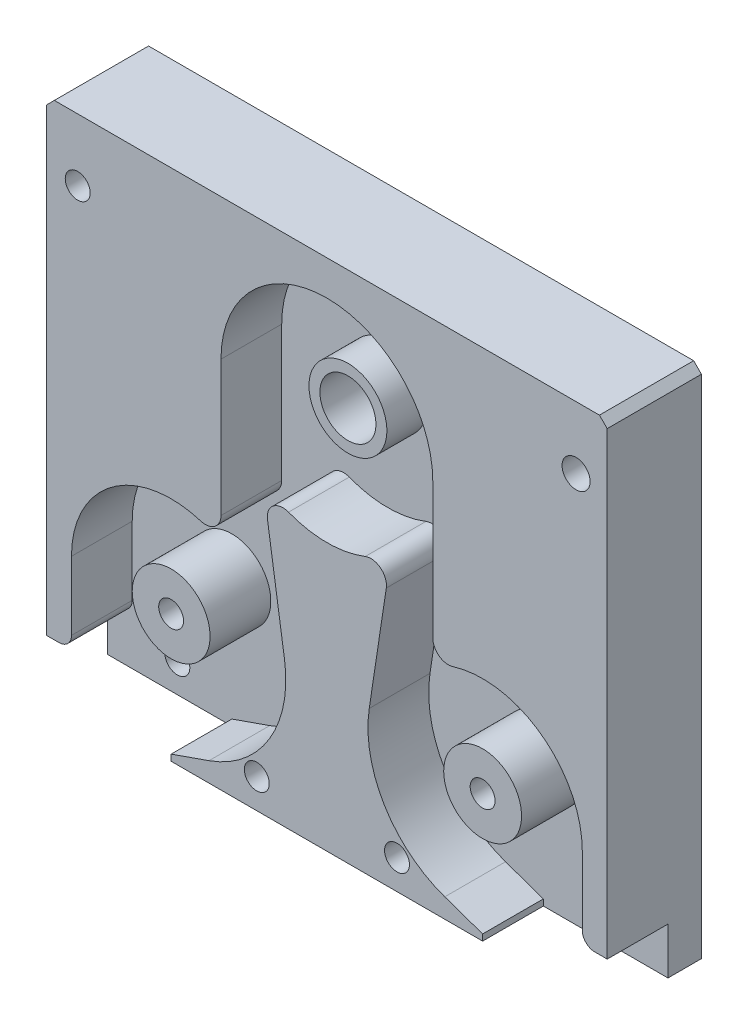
ISO-10303-21;
HEADER;
FILE_DESCRIPTION(('STEP AP214'),'2;1');
FILE_NAME('part.step','',(''),(''),'','','');
FILE_SCHEMA(('AUTOMOTIVE_DESIGN { 1 0 10303 214 1 1 1 1 }'));
ENDSEC;
DATA;
#1=APPLICATION_CONTEXT('core data for automotive mechanical design processes');
#2=APPLICATION_PROTOCOL_DEFINITION('international standard','automotive_design',2000,#1);
#3=PRODUCT_CONTEXT('',#1,'mechanical');
#4=PRODUCT('Part','Part','',(#3));
#5=PRODUCT_RELATED_PRODUCT_CATEGORY('part','',(#4));
#6=PRODUCT_DEFINITION_FORMATION('','',#4);
#7=PRODUCT_DEFINITION_CONTEXT('part definition',#1,'design');
#8=PRODUCT_DEFINITION('design','',#6,#7);
#9=PRODUCT_DEFINITION_SHAPE('','',#8);
#10=(LENGTH_UNIT() NAMED_UNIT(*) SI_UNIT(.MILLI.,.METRE.));
#11=(NAMED_UNIT(*) PLANE_ANGLE_UNIT() SI_UNIT($,.RADIAN.));
#12=(NAMED_UNIT(*) SI_UNIT($,.STERADIAN.) SOLID_ANGLE_UNIT());
#13=UNCERTAINTY_MEASURE_WITH_UNIT(LENGTH_MEASURE(1.E-05),#10,'distance_accuracy_value','');
#14=(GEOMETRIC_REPRESENTATION_CONTEXT(3) GLOBAL_UNCERTAINTY_ASSIGNED_CONTEXT((#13)) GLOBAL_UNIT_ASSIGNED_CONTEXT((#10,
#11,#12)) REPRESENTATION_CONTEXT('',''));
#15=CARTESIAN_POINT('',(0.,0.,0.));
#16=DIRECTION('',(0.,0.,1.));
#17=DIRECTION('',(1.,0.,0.));
#18=AXIS2_PLACEMENT_3D('',#15,#16,#17);
#19=CARTESIAN_POINT('',(-50.,42.5,-20.));
#20=DIRECTION('',(0.,0.,-1.));
#21=DIRECTION('',(-1.,0.,0.));
#22=AXIS2_PLACEMENT_3D('',#19,#20,#21);
#23=PLANE('',#22);
#24=CARTESIAN_POINT('',(-50.,42.5,-20.));
#25=DIRECTION('',(0.,0.,-1.));
#26=DIRECTION('',(-1.,0.,0.));
#27=AXIS2_PLACEMENT_3D('',#24,#25,#26);
#28=CIRCLE('',#27,4.);
#29=CARTESIAN_POINT('',(-54.,42.5,-20.));
#30=VERTEX_POINT('',#29);
#31=EDGE_CURVE('E19',#30,#30,#28,.F.);
#32=ORIENTED_EDGE('',*,*,#31,.T.);
#33=EDGE_LOOP('',(#32));
#34=FACE_BOUND('',#33,.T.);
#35=ADVANCED_FACE('F15',(#34),#23,.F.);
#36=CARTESIAN_POINT('',(0.,121.3,-26.75));
#37=DIRECTION('',(0.,0.,-1.));
#38=DIRECTION('',(-1.,0.,0.));
#39=AXIS2_PLACEMENT_3D('',#36,#37,#38);
#40=PLANE('',#39);
#41=CARTESIAN_POINT('',(0.,121.3,-26.75));
#42=DIRECTION('',(0.,0.,-1.));
#43=DIRECTION('',(-1.,0.,0.));
#44=AXIS2_PLACEMENT_3D('',#41,#42,#43);
#45=CIRCLE('',#44,9.);
#46=CARTESIAN_POINT('',(-8.99999999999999,121.3,-26.75));
#47=VERTEX_POINT('',#46);
#48=EDGE_CURVE('E497',#47,#47,#45,.F.);
#49=ORIENTED_EDGE('',*,*,#48,.T.);
#50=EDGE_LOOP('',(#49));
#51=FACE_BOUND('',#50,.T.);
#52=ADVANCED_FACE('F508',(#51),#40,.F.);
#53=CARTESIAN_POINT('',(-50.,42.5,0.));
#54=DIRECTION('',(0.,0.,-1.));
#55=DIRECTION('',(-1.,0.,0.));
#56=AXIS2_PLACEMENT_3D('',#53,#54,#55);
#57=CYLINDRICAL_SURFACE('',#56,4.);
#58=CARTESIAN_POINT('',(-50.,42.5,0.));
#59=DIRECTION('',(0.,0.,-1.));
#60=DIRECTION('',(-1.,0.,0.));
#61=AXIS2_PLACEMENT_3D('',#58,#59,#60);
#62=CIRCLE('',#61,4.);
#63=CARTESIAN_POINT('',(-54.,42.5,0.));
#64=VERTEX_POINT('',#63);
#65=EDGE_CURVE('E495',#64,#64,#62,.T.);
#66=ORIENTED_EDGE('',*,*,#65,.F.);
#67=EDGE_LOOP('',(#66));
#68=FACE_BOUND('',#67,.T.);
#69=ORIENTED_EDGE('',*,*,#31,.F.);
#70=EDGE_LOOP('',(#69));
#71=FACE_BOUND('',#70,.T.);
#72=ADVANCED_FACE('F505',(#68,#71),#57,.F.);
#73=CARTESIAN_POINT('',(0.,121.3,0.));
#74=DIRECTION('',(0.,0.,-1.));
#75=DIRECTION('',(-1.,0.,0.));
#76=AXIS2_PLACEMENT_3D('',#73,#74,#75);
#77=CYLINDRICAL_SURFACE('',#76,9.);
#78=ORIENTED_EDGE('',*,*,#48,.F.);
#79=EDGE_LOOP('',(#78));
#80=FACE_BOUND('',#79,.T.);
#81=CARTESIAN_POINT('',(0.,121.3,-6.75));
#82=DIRECTION('',(0.,0.,-1.));
#83=DIRECTION('',(-1.,0.,0.));
#84=AXIS2_PLACEMENT_3D('',#81,#82,#83);
#85=CIRCLE('',#84,9.);
#86=CARTESIAN_POINT('',(-8.99999999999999,121.3,-6.75));
#87=VERTEX_POINT('',#86);
#88=EDGE_CURVE('E492',#87,#87,#85,.F.);
#89=ORIENTED_EDGE('',*,*,#88,.T.);
#90=EDGE_LOOP('',(#89));
#91=FACE_BOUND('',#90,.T.);
#92=ADVANCED_FACE('F507',(#80,#91),#77,.F.);
#93=CARTESIAN_POINT('',(-80.,146.5,-20.));
#94=DIRECTION('',(0.,0.,-1.));
#95=DIRECTION('',(-1.,0.,0.));
#96=AXIS2_PLACEMENT_3D('',#93,#94,#95);
#97=PLANE('',#96);
#98=CARTESIAN_POINT('',(-80.,146.5,-20.));
#99=DIRECTION('',(0.,0.,-1.));
#100=DIRECTION('',(-1.,0.,0.));
#101=AXIS2_PLACEMENT_3D('',#98,#99,#100);
#102=CIRCLE('',#101,4.);
#103=CARTESIAN_POINT('',(-84.,146.5,-20.));
#104=VERTEX_POINT('',#103);
#105=EDGE_CURVE('E489',#104,#104,#102,.F.);
#106=ORIENTED_EDGE('',*,*,#105,.T.);
#107=EDGE_LOOP('',(#106));
#108=FACE_BOUND('',#107,.T.);
#109=ADVANCED_FACE('F516',(#108),#97,.F.);
#110=CARTESIAN_POINT('',(0.,84.,0.));
#111=DIRECTION('',(0.,0.,1.));
#112=DIRECTION('',(1.,0.,0.));
#113=AXIS2_PLACEMENT_3D('',#110,#111,#112);
#114=PLANE('',#113);
#115=CARTESIAN_POINT('',(50.,42.5,0.));
#116=DIRECTION('',(0.,0.,-1.));
#117=DIRECTION('',(-1.,0.,0.));
#118=AXIS2_PLACEMENT_3D('',#115,#116,#117);
#119=CIRCLE('',#118,4.);
#120=CARTESIAN_POINT('',(45.9999999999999,42.5,0.));
#121=VERTEX_POINT('',#120);
#122=EDGE_CURVE('E334',#121,#121,#119,.T.);
#123=ORIENTED_EDGE('',*,*,#122,.T.);
#124=EDGE_LOOP('',(#123));
#125=FACE_BOUND('',#124,.T.);
#126=CARTESIAN_POINT('',(50.,42.5,0.));
#127=DIRECTION('',(0.,0.,-1.));
#128=DIRECTION('',(-1.,0.,0.));
#129=AXIS2_PLACEMENT_3D('',#126,#127,#128);
#130=CIRCLE('',#129,12.5);
#131=CARTESIAN_POINT('',(37.5,42.5,0.));
#132=VERTEX_POINT('',#131);
#133=EDGE_CURVE('E238',#132,#132,#130,.T.);
#134=ORIENTED_EDGE('',*,*,#133,.F.);
#135=EDGE_LOOP('',(#134));
#136=FACE_BOUND('',#135,.T.);
#137=ADVANCED_FACE('F705',(#125,#136),#114,.T.);
#138=CARTESIAN_POINT('',(0.,84.,0.));
#139=DIRECTION('',(0.,0.,1.));
#140=DIRECTION('',(1.,0.,0.));
#141=AXIS2_PLACEMENT_3D('',#138,#139,#140);
#142=PLANE('',#141);
#143=ORIENTED_EDGE('',*,*,#65,.T.);
#144=EDGE_LOOP('',(#143));
#145=FACE_BOUND('',#144,.T.);
#146=CARTESIAN_POINT('',(-50.,42.5,0.));
#147=DIRECTION('',(0.,0.,-1.));
#148=DIRECTION('',(-1.,0.,0.));
#149=AXIS2_PLACEMENT_3D('',#146,#147,#148);
#150=CIRCLE('',#149,12.5);
#151=CARTESIAN_POINT('',(-62.5,42.5,0.));
#152=VERTEX_POINT('',#151);
#153=EDGE_CURVE('E482',#152,#152,#150,.T.);
#154=ORIENTED_EDGE('',*,*,#153,.F.);
#155=EDGE_LOOP('',(#154));
#156=FACE_BOUND('',#155,.T.);
#157=ADVANCED_FACE('F701',(#145,#156),#142,.T.);
#158=CARTESIAN_POINT('',(0.,121.3,-6.75));
#159=DIRECTION('',(0.,0.,-1.));
#160=DIRECTION('',(-1.,0.,0.));
#161=AXIS2_PLACEMENT_3D('',#158,#159,#160);
#162=PLANE('',#161);
#163=ORIENTED_EDGE('',*,*,#88,.F.);
#164=EDGE_LOOP('',(#163));
#165=FACE_BOUND('',#164,.T.);
#166=CARTESIAN_POINT('',(0.,121.3,-6.75));
#167=DIRECTION('',(0.,0.,-1.));
#168=DIRECTION('',(-1.,0.,0.));
#169=AXIS2_PLACEMENT_3D('',#166,#167,#168);
#170=CIRCLE('',#169,12.5);
#171=CARTESIAN_POINT('',(-12.5,121.3,-6.75));
#172=VERTEX_POINT('',#171);
#173=EDGE_CURVE('E267',#172,#172,#170,.T.);
#174=ORIENTED_EDGE('',*,*,#173,.F.);
#175=EDGE_LOOP('',(#174));
#176=FACE_BOUND('',#175,.T.);
#177=ADVANCED_FACE('F697',(#165,#176),#162,.F.);
#178=CARTESIAN_POINT('',(-80.,146.5,0.));
#179=DIRECTION('',(0.,0.,-1.));
#180=DIRECTION('',(-1.,0.,0.));
#181=AXIS2_PLACEMENT_3D('',#178,#179,#180);
#182=CYLINDRICAL_SURFACE('',#181,4.);
#183=CARTESIAN_POINT('',(-80.,146.5,0.));
#184=DIRECTION('',(0.,0.,-1.));
#185=DIRECTION('',(-1.,0.,0.));
#186=AXIS2_PLACEMENT_3D('',#183,#184,#185);
#187=CIRCLE('',#186,4.);
#188=CARTESIAN_POINT('',(-84.,146.5,0.));
#189=VERTEX_POINT('',#188);
#190=EDGE_CURVE('E461',#189,#189,#187,.T.);
#191=ORIENTED_EDGE('',*,*,#190,.F.);
#192=EDGE_LOOP('',(#191));
#193=FACE_BOUND('',#192,.T.);
#194=ORIENTED_EDGE('',*,*,#105,.F.);
#195=EDGE_LOOP('',(#194));
#196=FACE_BOUND('',#195,.T.);
#197=ADVANCED_FACE('F693',(#193,#196),#182,.F.);
#198=CARTESIAN_POINT('',(50.,42.5,0.));
#199=DIRECTION('',(0.,0.,-1.));
#200=DIRECTION('',(-1.,0.,0.));
#201=AXIS2_PLACEMENT_3D('',#198,#199,#200);
#202=CYLINDRICAL_SURFACE('',#201,4.);
#203=ORIENTED_EDGE('',*,*,#122,.F.);
#204=EDGE_LOOP('',(#203));
#205=FACE_BOUND('',#204,.T.);
#206=CARTESIAN_POINT('',(50.,42.5,-21.25));
#207=DIRECTION('',(0.,0.,-1.));
#208=DIRECTION('',(-1.,0.,0.));
#209=AXIS2_PLACEMENT_3D('',#206,#207,#208);
#210=CIRCLE('',#209,4.);
#211=CARTESIAN_POINT('',(45.9999999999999,42.5,-21.25));
#212=VERTEX_POINT('',#211);
#213=EDGE_CURVE('E455',#212,#212,#210,.T.);
#214=ORIENTED_EDGE('',*,*,#213,.T.);
#215=EDGE_LOOP('',(#214));
#216=FACE_BOUND('',#215,.T.);
#217=ADVANCED_FACE('F689',(#205,#216),#202,.F.);
#218=CARTESIAN_POINT('',(79.9999999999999,146.5,0.));
#219=DIRECTION('',(0.,0.,-1.));
#220=DIRECTION('',(-1.,0.,0.));
#221=AXIS2_PLACEMENT_3D('',#218,#219,#220);
#222=CYLINDRICAL_SURFACE('',#221,4.5);
#223=CARTESIAN_POINT('',(79.9999999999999,146.5,0.));
#224=DIRECTION('',(0.,0.,-1.));
#225=DIRECTION('',(-1.,0.,0.));
#226=AXIS2_PLACEMENT_3D('',#223,#224,#225);
#227=CIRCLE('',#226,4.5);
#228=CARTESIAN_POINT('',(75.4999999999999,146.5,0.));
#229=VERTEX_POINT('',#228);
#230=EDGE_CURVE('E458',#229,#229,#227,.T.);
#231=ORIENTED_EDGE('',*,*,#230,.F.);
#232=EDGE_LOOP('',(#231));
#233=FACE_BOUND('',#232,.T.);
#234=CARTESIAN_POINT('',(79.9999999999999,146.5,-21.25));
#235=DIRECTION('',(0.,0.,-1.));
#236=DIRECTION('',(-1.,0.,0.));
#237=AXIS2_PLACEMENT_3D('',#234,#235,#236);
#238=CIRCLE('',#237,4.5);
#239=CARTESIAN_POINT('',(75.4999999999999,146.5,-21.25));
#240=VERTEX_POINT('',#239);
#241=EDGE_CURVE('E353',#240,#240,#238,.T.);
#242=ORIENTED_EDGE('',*,*,#241,.T.);
#243=EDGE_LOOP('',(#242));
#244=FACE_BOUND('',#243,.T.);
#245=ADVANCED_FACE('F685',(#233,#244),#222,.F.);
#246=CARTESIAN_POINT('',(-50.,3.5,0.));
#247=DIRECTION('',(0.330013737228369,-0.943976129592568,0.));
#248=DIRECTION('',(0.943976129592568,0.330013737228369,0.));
#249=AXIS2_PLACEMENT_3D('',#246,#247,#248);
#250=PLANE('',#249);
#251=DIRECTION('',(0.,0.,-1.));
#252=VECTOR('',#251,1.);
#253=CARTESIAN_POINT('',(-50.,3.5,0.));
#254=LINE('',#253,#252);
#255=CARTESIAN_POINT('',(-50.,3.5,-19.5));
#256=VERTEX_POINT('',#255);
#257=CARTESIAN_POINT('',(-50.,3.5,0.));
#258=VERTEX_POINT('',#257);
#259=EDGE_CURVE('E300',#256,#258,#254,.F.);
#260=ORIENTED_EDGE('',*,*,#259,.T.);
#261=DIRECTION('',(-0.943976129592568,-0.330013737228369,0.));
#262=VECTOR('',#261,1.);
#263=CARTESIAN_POINT('',(-37.8505214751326,7.74745360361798,0.));
#264=LINE('',#263,#262);
#265=CARTESIAN_POINT('',(-37.8505214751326,7.74745360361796,0.));
#266=VERTEX_POINT('',#265);
#267=EDGE_CURVE('E348',#266,#258,#264,.T.);
#268=ORIENTED_EDGE('',*,*,#267,.F.);
#269=DIRECTION('',(0.,0.,-1.));
#270=VECTOR('',#269,1.);
#271=CARTESIAN_POINT('',(-37.8505214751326,7.74745360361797,0.));
#272=LINE('',#271,#270);
#273=CARTESIAN_POINT('',(-37.8505214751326,7.74745360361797,-19.5));
#274=VERTEX_POINT('',#273);
#275=EDGE_CURVE('E331',#266,#274,#272,.T.);
#276=ORIENTED_EDGE('',*,*,#275,.T.);
#277=DIRECTION('',(0.943976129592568,0.33001373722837,0.));
#278=VECTOR('',#277,1.);
#279=CARTESIAN_POINT('',(-50.,3.5,-19.5));
#280=LINE('',#279,#278);
#281=EDGE_CURVE('E338',#256,#274,#280,.T.);
#282=ORIENTED_EDGE('',*,*,#281,.F.);
#283=EDGE_LOOP('',(#260,#268,#276,#282));
#284=FACE_BOUND('',#283,.T.);
#285=ADVANCED_FACE('F681',(#284),#250,.F.);
#286=CARTESIAN_POINT('',(-50.,42.5,0.));
#287=DIRECTION('',(0.,0.,-1.));
#288=DIRECTION('',(-1.,0.,0.));
#289=AXIS2_PLACEMENT_3D('',#286,#287,#288);
#290=CYLINDRICAL_SURFACE('',#289,36.8150690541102);
#291=ORIENTED_EDGE('',*,*,#275,.F.);
#292=CARTESIAN_POINT('',(-50.,42.5,0.));
#293=DIRECTION('',(0.,0.,-1.));
#294=DIRECTION('',(-1.,0.,0.));
#295=AXIS2_PLACEMENT_3D('',#292,#293,#294);
#296=CIRCLE('',#295,36.8150690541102);
#297=CARTESIAN_POINT('',(-13.5982629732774,48.0011681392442,0.));
#298=VERTEX_POINT('',#297);
#299=EDGE_CURVE('E436',#298,#266,#296,.T.);
#300=ORIENTED_EDGE('',*,*,#299,.F.);
#301=DIRECTION('',(0.,0.,1.));
#302=VECTOR('',#301,1.);
#303=CARTESIAN_POINT('',(-13.5982629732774,48.0011681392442,0.));
#304=LINE('',#303,#302);
#305=CARTESIAN_POINT('',(-13.5982629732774,48.0011681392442,-19.5));
#306=VERTEX_POINT('',#305);
#307=EDGE_CURVE('E328',#298,#306,#304,.F.);
#308=ORIENTED_EDGE('',*,*,#307,.T.);
#309=CARTESIAN_POINT('',(-50.,42.5,-19.5));
#310=DIRECTION('',(0.,0.,-1.));
#311=DIRECTION('',(-1.,0.,0.));
#312=AXIS2_PLACEMENT_3D('',#309,#310,#311);
#313=CIRCLE('',#312,36.8150690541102);
#314=EDGE_CURVE('E434',#274,#306,#313,.F.);
#315=ORIENTED_EDGE('',*,*,#314,.F.);
#316=EDGE_LOOP('',(#291,#300,#308,#315));
#317=FACE_BOUND('',#316,.T.);
#318=ADVANCED_FACE('F677',(#317),#290,.F.);
#319=CARTESIAN_POINT('',(-13.5982629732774,48.0011681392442,0.));
#320=DIRECTION('',(0.988772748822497,0.149427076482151,0.));
#321=DIRECTION('',(-0.149427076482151,0.988772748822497,0.));
#322=AXIS2_PLACEMENT_3D('',#319,#320,#321);
#323=PLANE('',#322);
#324=ORIENTED_EDGE('',*,*,#307,.F.);
#325=DIRECTION('',(0.149427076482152,-0.988772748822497,0.));
#326=VECTOR('',#325,1.);
#327=CARTESIAN_POINT('',(-19.0688637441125,84.2006380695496,0.));
#328=LINE('',#327,#326);
#329=CARTESIAN_POINT('',(-19.0688637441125,84.2006380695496,0.));
#330=VERTEX_POINT('',#329);
#331=EDGE_CURVE('E439',#330,#298,#328,.T.);
#332=ORIENTED_EDGE('',*,*,#331,.F.);
#333=DIRECTION('',(0.,0.,-1.));
#334=VECTOR('',#333,1.);
#335=CARTESIAN_POINT('',(-19.0688637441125,84.2006380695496,0.));
#336=LINE('',#335,#334);
#337=CARTESIAN_POINT('',(-19.0688637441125,84.2006380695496,-19.5));
#338=VERTEX_POINT('',#337);
#339=EDGE_CURVE('E326',#338,#330,#336,.F.);
#340=ORIENTED_EDGE('',*,*,#339,.F.);
#341=DIRECTION('',(-0.149427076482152,0.988772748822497,0.));
#342=VECTOR('',#341,1.);
#343=CARTESIAN_POINT('',(-13.5982629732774,48.0011681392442,-19.5));
#344=LINE('',#343,#342);
#345=EDGE_CURVE('E433',#306,#338,#344,.T.);
#346=ORIENTED_EDGE('',*,*,#345,.F.);
#347=EDGE_LOOP('',(#324,#332,#340,#346));
#348=FACE_BOUND('',#347,.T.);
#349=ADVANCED_FACE('F673',(#348),#323,.F.);
#350=CARTESIAN_POINT('',(-14.125,84.9477734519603,0.));
#351=DIRECTION('',(0.,0.,-1.));
#352=DIRECTION('',(-1.,0.,0.));
#353=AXIS2_PLACEMENT_3D('',#350,#351,#352);
#354=CYLINDRICAL_SURFACE('',#353,5.);
#355=CARTESIAN_POINT('',(-14.125,84.9477734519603,0.));
#356=DIRECTION('',(0.,0.,-1.));
#357=DIRECTION('',(-1.,0.,0.));
#358=AXIS2_PLACEMENT_3D('',#355,#356,#357);
#359=CIRCLE('',#358,5.);
#360=CARTESIAN_POINT('',(-12.3141025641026,89.6083153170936,0.));
#361=VERTEX_POINT('',#360);
#362=EDGE_CURVE('E440',#361,#330,#359,.F.);
#363=ORIENTED_EDGE('',*,*,#362,.F.);
#364=DIRECTION('',(0.,0.,-1.));
#365=VECTOR('',#364,1.);
#366=CARTESIAN_POINT('',(-12.3141025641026,89.6083153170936,0.));
#367=LINE('',#366,#365);
#368=CARTESIAN_POINT('',(-12.3141025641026,89.6083153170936,-19.5));
#369=VERTEX_POINT('',#368);
#370=EDGE_CURVE('E323',#361,#369,#367,.T.);
#371=ORIENTED_EDGE('',*,*,#370,.T.);
#372=CARTESIAN_POINT('',(-14.125,84.9477734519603,-19.5));
#373=DIRECTION('',(0.,0.,-1.));
#374=DIRECTION('',(-1.,0.,0.));
#375=AXIS2_PLACEMENT_3D('',#372,#373,#374);
#376=CIRCLE('',#375,5.);
#377=EDGE_CURVE('E431',#338,#369,#376,.T.);
#378=ORIENTED_EDGE('',*,*,#377,.F.);
#379=ORIENTED_EDGE('',*,*,#339,.T.);
#380=EDGE_LOOP('',(#363,#371,#378,#379));
#381=FACE_BOUND('',#380,.T.);
#382=ADVANCED_FACE('F669',(#381),#354,.T.);
#383=CARTESIAN_POINT('',(0.,121.3,0.));
#384=DIRECTION('',(0.,0.,-1.));
#385=DIRECTION('',(-1.,0.,0.));
#386=AXIS2_PLACEMENT_3D('',#383,#384,#385);
#387=CYLINDRICAL_SURFACE('',#386,34.);
#388=ORIENTED_EDGE('',*,*,#370,.F.);
#389=CARTESIAN_POINT('',(0.,121.3,0.));
#390=DIRECTION('',(0.,0.,-1.));
#391=DIRECTION('',(-1.,0.,0.));
#392=AXIS2_PLACEMENT_3D('',#389,#390,#391);
#393=CIRCLE('',#392,34.);
#394=CARTESIAN_POINT('',(12.3141025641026,89.6083153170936,0.));
#395=VERTEX_POINT('',#394);
#396=EDGE_CURVE('E443',#395,#361,#393,.T.);
#397=ORIENTED_EDGE('',*,*,#396,.F.);
#398=DIRECTION('',(0.,0.,-1.));
#399=VECTOR('',#398,1.);
#400=CARTESIAN_POINT('',(12.3141025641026,89.6083153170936,0.));
#401=LINE('',#400,#399);
#402=CARTESIAN_POINT('',(12.3141025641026,89.6083153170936,-19.5));
#403=VERTEX_POINT('',#402);
#404=EDGE_CURVE('E321',#403,#395,#401,.F.);
#405=ORIENTED_EDGE('',*,*,#404,.F.);
#406=CARTESIAN_POINT('',(0.,121.3,-19.5));
#407=DIRECTION('',(0.,0.,-1.));
#408=DIRECTION('',(-1.,0.,0.));
#409=AXIS2_PLACEMENT_3D('',#406,#407,#408);
#410=CIRCLE('',#409,34.);
#411=EDGE_CURVE('E429',#369,#403,#410,.F.);
#412=ORIENTED_EDGE('',*,*,#411,.F.);
#413=EDGE_LOOP('',(#388,#397,#405,#412));
#414=FACE_BOUND('',#413,.T.);
#415=ADVANCED_FACE('F665',(#414),#387,.F.);
#416=CARTESIAN_POINT('',(14.125,84.9477734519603,0.));
#417=DIRECTION('',(0.,0.,-1.));
#418=DIRECTION('',(-1.,0.,0.));
#419=AXIS2_PLACEMENT_3D('',#416,#417,#418);
#420=CYLINDRICAL_SURFACE('',#419,5.);
#421=CARTESIAN_POINT('',(14.125,84.9477734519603,0.));
#422=DIRECTION('',(0.,0.,-1.));
#423=DIRECTION('',(-1.,0.,0.));
#424=AXIS2_PLACEMENT_3D('',#421,#422,#423);
#425=CIRCLE('',#424,5.);
#426=CARTESIAN_POINT('',(19.0688637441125,84.2006380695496,0.));
#427=VERTEX_POINT('',#426);
#428=EDGE_CURVE('E446',#427,#395,#425,.F.);
#429=ORIENTED_EDGE('',*,*,#428,.F.);
#430=DIRECTION('',(0.,0.,1.));
#431=VECTOR('',#430,1.);
#432=CARTESIAN_POINT('',(19.0688637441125,84.2006380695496,0.));
#433=LINE('',#432,#431);
#434=CARTESIAN_POINT('',(19.0688637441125,84.2006380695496,-19.5));
#435=VERTEX_POINT('',#434);
#436=EDGE_CURVE('E318',#427,#435,#433,.F.);
#437=ORIENTED_EDGE('',*,*,#436,.T.);
#438=CARTESIAN_POINT('',(14.125,84.9477734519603,-19.5));
#439=DIRECTION('',(0.,0.,-1.));
#440=DIRECTION('',(-1.,0.,0.));
#441=AXIS2_PLACEMENT_3D('',#438,#439,#440);
#442=CIRCLE('',#441,5.);
#443=EDGE_CURVE('E427',#403,#435,#442,.T.);
#444=ORIENTED_EDGE('',*,*,#443,.F.);
#445=ORIENTED_EDGE('',*,*,#404,.T.);
#446=EDGE_LOOP('',(#429,#437,#444,#445));
#447=FACE_BOUND('',#446,.T.);
#448=ADVANCED_FACE('F661',(#447),#420,.T.);
#449=CARTESIAN_POINT('',(19.0688637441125,84.2006380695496,0.));
#450=DIRECTION('',(-0.988772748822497,0.14942707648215,0.));
#451=DIRECTION('',(-0.14942707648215,-0.988772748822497,0.));
#452=AXIS2_PLACEMENT_3D('',#449,#450,#451);
#453=PLANE('',#452);
#454=ORIENTED_EDGE('',*,*,#436,.F.);
#455=DIRECTION('',(0.14942707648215,0.988772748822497,0.));
#456=VECTOR('',#455,1.);
#457=CARTESIAN_POINT('',(13.5982629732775,48.0011681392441,0.));
#458=LINE('',#457,#456);
#459=CARTESIAN_POINT('',(13.5982629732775,48.0011681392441,0.));
#460=VERTEX_POINT('',#459);
#461=EDGE_CURVE('E449',#460,#427,#458,.T.);
#462=ORIENTED_EDGE('',*,*,#461,.F.);
#463=DIRECTION('',(0.,0.,-1.));
#464=VECTOR('',#463,1.);
#465=CARTESIAN_POINT('',(13.5982629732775,48.0011681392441,0.));
#466=LINE('',#465,#464);
#467=CARTESIAN_POINT('',(13.5982629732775,48.0011681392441,-19.5));
#468=VERTEX_POINT('',#467);
#469=EDGE_CURVE('E309',#460,#468,#466,.T.);
#470=ORIENTED_EDGE('',*,*,#469,.T.);
#471=DIRECTION('',(-0.14942707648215,-0.988772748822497,0.));
#472=VECTOR('',#471,1.);
#473=CARTESIAN_POINT('',(19.0688637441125,84.2006380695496,-19.5));
#474=LINE('',#473,#472);
#475=EDGE_CURVE('E426',#435,#468,#474,.T.);
#476=ORIENTED_EDGE('',*,*,#475,.F.);
#477=EDGE_LOOP('',(#454,#462,#470,#476));
#478=FACE_BOUND('',#477,.T.);
#479=ADVANCED_FACE('F657',(#478),#453,.F.);
#480=CARTESIAN_POINT('',(50.,42.5,0.));
#481=DIRECTION('',(0.,0.,-1.));
#482=DIRECTION('',(-1.,0.,0.));
#483=AXIS2_PLACEMENT_3D('',#480,#481,#482);
#484=CYLINDRICAL_SURFACE('',#483,36.8150690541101);
#485=ORIENTED_EDGE('',*,*,#469,.F.);
#486=CARTESIAN_POINT('',(50.,42.5,0.));
#487=DIRECTION('',(0.,0.,-1.));
#488=DIRECTION('',(-1.,0.,0.));
#489=AXIS2_PLACEMENT_3D('',#486,#487,#488);
#490=CIRCLE('',#489,36.8150690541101);
#491=CARTESIAN_POINT('',(37.8505214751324,7.74745360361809,0.));
#492=VERTEX_POINT('',#491);
#493=EDGE_CURVE('E450',#492,#460,#490,.T.);
#494=ORIENTED_EDGE('',*,*,#493,.F.);
#495=DIRECTION('',(0.,0.,1.));
#496=VECTOR('',#495,1.);
#497=CARTESIAN_POINT('',(37.8505214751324,7.7474536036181,0.));
#498=LINE('',#497,#496);
#499=CARTESIAN_POINT('',(37.8505214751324,7.7474536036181,-19.5));
#500=VERTEX_POINT('',#499);
#501=EDGE_CURVE('E298',#492,#500,#498,.F.);
#502=ORIENTED_EDGE('',*,*,#501,.T.);
#503=CARTESIAN_POINT('',(50.,42.5,-19.5));
#504=DIRECTION('',(0.,0.,-1.));
#505=DIRECTION('',(-1.,0.,0.));
#506=AXIS2_PLACEMENT_3D('',#503,#504,#505);
#507=CIRCLE('',#506,36.8150690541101);
#508=EDGE_CURVE('E424',#468,#500,#507,.F.);
#509=ORIENTED_EDGE('',*,*,#508,.F.);
#510=EDGE_LOOP('',(#485,#494,#502,#509));
#511=FACE_BOUND('',#510,.T.);
#512=ADVANCED_FACE('F653',(#511),#484,.F.);
#513=CARTESIAN_POINT('',(37.8505214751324,7.7474536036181,0.));
#514=DIRECTION('',(-0.330013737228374,-0.943976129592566,0.));
#515=DIRECTION('',(0.943976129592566,-0.330013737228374,0.));
#516=AXIS2_PLACEMENT_3D('',#513,#514,#515);
#517=PLANE('',#516);
#518=ORIENTED_EDGE('',*,*,#501,.F.);
#519=DIRECTION('',(-0.943976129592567,0.330013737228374,0.));
#520=VECTOR('',#519,1.);
#521=CARTESIAN_POINT('',(50.,3.5,0.));
#522=LINE('',#521,#520);
#523=CARTESIAN_POINT('',(50.,3.50000000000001,0.));
#524=VERTEX_POINT('',#523);
#525=EDGE_CURVE('E352',#524,#492,#522,.T.);
#526=ORIENTED_EDGE('',*,*,#525,.F.);
#527=DIRECTION('',(0.,0.,1.));
#528=VECTOR('',#527,1.);
#529=CARTESIAN_POINT('',(50.,3.5,0.));
#530=LINE('',#529,#528);
#531=CARTESIAN_POINT('',(50.,3.5,-19.5));
#532=VERTEX_POINT('',#531);
#533=EDGE_CURVE('E266',#524,#532,#530,.F.);
#534=ORIENTED_EDGE('',*,*,#533,.T.);
#535=DIRECTION('',(0.943976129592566,-0.330013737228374,0.));
#536=VECTOR('',#535,1.);
#537=CARTESIAN_POINT('',(37.8505214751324,7.7474536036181,-19.5));
#538=LINE('',#537,#536);
#539=EDGE_CURVE('E315',#500,#532,#538,.T.);
#540=ORIENTED_EDGE('',*,*,#539,.F.);
#541=EDGE_LOOP('',(#518,#526,#534,#540));
#542=FACE_BOUND('',#541,.T.);
#543=ADVANCED_FACE('F649',(#542),#517,.F.);
#544=CARTESIAN_POINT('',(86.,20.5,0.));
#545=DIRECTION('',(0.,0.,-1.));
#546=DIRECTION('',(-1.,0.,0.));
#547=AXIS2_PLACEMENT_3D('',#544,#545,#546);
#548=CYLINDRICAL_SURFACE('',#547,4.00000000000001);
#549=CARTESIAN_POINT('',(86.,20.5,0.));
#550=DIRECTION('',(0.,0.,-1.));
#551=DIRECTION('',(-1.,0.,0.));
#552=AXIS2_PLACEMENT_3D('',#549,#550,#551);
#553=CIRCLE('',#552,4.00000000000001);
#554=CARTESIAN_POINT('',(82.,20.5,0.));
#555=VERTEX_POINT('',#554);
#556=CARTESIAN_POINT('',(86.,16.5,0.));
#557=VERTEX_POINT('',#556);
#558=EDGE_CURVE('E464',#555,#557,#553,.F.);
#559=ORIENTED_EDGE('',*,*,#558,.F.);
#560=DIRECTION('',(0.,0.,-1.));
#561=VECTOR('',#560,1.);
#562=CARTESIAN_POINT('',(82.,20.5,0.));
#563=LINE('',#562,#561);
#564=CARTESIAN_POINT('',(82.,20.5,-19.5));
#565=VERTEX_POINT('',#564);
#566=EDGE_CURVE('E295',#555,#565,#563,.T.);
#567=ORIENTED_EDGE('',*,*,#566,.T.);
#568=CARTESIAN_POINT('',(86.,20.5,-19.5));
#569=DIRECTION('',(0.,0.,-1.));
#570=DIRECTION('',(-1.,0.,0.));
#571=AXIS2_PLACEMENT_3D('',#568,#569,#570);
#572=CIRCLE('',#571,4.00000000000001);
#573=CARTESIAN_POINT('',(86.,16.5,-19.5));
#574=VERTEX_POINT('',#573);
#575=EDGE_CURVE('E422',#574,#565,#572,.T.);
#576=ORIENTED_EDGE('',*,*,#575,.F.);
#577=DIRECTION('',(0.,0.,1.));
#578=VECTOR('',#577,1.);
#579=CARTESIAN_POINT('',(86.,16.5,0.));
#580=LINE('',#579,#578);
#581=EDGE_CURVE('E264',#574,#557,#580,.T.);
#582=ORIENTED_EDGE('',*,*,#581,.T.);
#583=EDGE_LOOP('',(#559,#567,#576,#582));
#584=FACE_BOUND('',#583,.T.);
#585=ADVANCED_FACE('F645',(#584),#548,.T.);
#586=CARTESIAN_POINT('',(82.,20.5,0.));
#587=DIRECTION('',(1.,0.,0.));
#588=DIRECTION('',(0.,0.,-1.));
#589=AXIS2_PLACEMENT_3D('',#586,#587,#588);
#590=PLANE('',#589);
#591=ORIENTED_EDGE('',*,*,#566,.F.);
#592=DIRECTION('',(0.,1.,0.));
#593=VECTOR('',#592,1.);
#594=CARTESIAN_POINT('',(81.9999999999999,84.,0.));
#595=LINE('',#594,#593);
#596=CARTESIAN_POINT('',(81.9999999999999,42.5,0.));
#597=VERTEX_POINT('',#596);
#598=EDGE_CURVE('E467',#597,#555,#595,.F.);
#599=ORIENTED_EDGE('',*,*,#598,.F.);
#600=DIRECTION('',(0.,0.,-1.));
#601=VECTOR('',#600,1.);
#602=CARTESIAN_POINT('',(81.9999999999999,42.5,0.));
#603=LINE('',#602,#601);
#604=CARTESIAN_POINT('',(81.9999999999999,42.5,-19.5));
#605=VERTEX_POINT('',#604);
#606=EDGE_CURVE('E292',#597,#605,#603,.T.);
#607=ORIENTED_EDGE('',*,*,#606,.T.);
#608=DIRECTION('',(0.,1.,0.));
#609=VECTOR('',#608,1.);
#610=CARTESIAN_POINT('',(82.,61.3926362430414,-19.5));
#611=LINE('',#610,#609);
#612=EDGE_CURVE('E421',#565,#605,#611,.T.);
#613=ORIENTED_EDGE('',*,*,#612,.F.);
#614=EDGE_LOOP('',(#591,#599,#607,#613));
#615=FACE_BOUND('',#614,.T.);
#616=ADVANCED_FACE('F641',(#615),#590,.F.);
#617=CARTESIAN_POINT('',(50.,42.5,0.));
#618=DIRECTION('',(0.,0.,-1.));
#619=DIRECTION('',(-1.,0.,0.));
#620=AXIS2_PLACEMENT_3D('',#617,#618,#619);
#621=CYLINDRICAL_SURFACE('',#620,32.);
#622=ORIENTED_EDGE('',*,*,#606,.F.);
#623=CARTESIAN_POINT('',(50.,42.5,0.));
#624=DIRECTION('',(0.,0.,-1.));
#625=DIRECTION('',(-1.,0.,0.));
#626=AXIS2_PLACEMENT_3D('',#623,#624,#625);
#627=CIRCLE('',#626,32.);
#628=CARTESIAN_POINT('',(40.4864864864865,73.0531186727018,0.));
#629=VERTEX_POINT('',#628);
#630=EDGE_CURVE('E468',#629,#597,#627,.T.);
#631=ORIENTED_EDGE('',*,*,#630,.F.);
#632=DIRECTION('',(0.,0.,-1.));
#633=VECTOR('',#632,1.);
#634=CARTESIAN_POINT('',(40.4864864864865,73.0531186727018,0.));
#635=LINE('',#634,#633);
#636=CARTESIAN_POINT('',(40.4864864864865,73.0531186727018,-19.5));
#637=VERTEX_POINT('',#636);
#638=EDGE_CURVE('E290',#637,#629,#635,.F.);
#639=ORIENTED_EDGE('',*,*,#638,.F.);
#640=CARTESIAN_POINT('',(50.,42.5,-19.5));
#641=DIRECTION('',(0.,0.,-1.));
#642=DIRECTION('',(-1.,0.,0.));
#643=AXIS2_PLACEMENT_3D('',#640,#641,#642);
#644=CIRCLE('',#643,32.);
#645=EDGE_CURVE('E419',#605,#637,#644,.F.);
#646=ORIENTED_EDGE('',*,*,#645,.F.);
#647=EDGE_LOOP('',(#622,#631,#639,#646));
#648=FACE_BOUND('',#647,.T.);
#649=ADVANCED_FACE('F637',(#648),#621,.F.);
#650=CARTESIAN_POINT('',(39.,77.8270434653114,0.));
#651=DIRECTION('',(0.,0.,-1.));
#652=DIRECTION('',(-1.,0.,0.));
#653=AXIS2_PLACEMENT_3D('',#650,#651,#652);
#654=CYLINDRICAL_SURFACE('',#653,5.);
#655=CARTESIAN_POINT('',(39.,77.8270434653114,0.));
#656=DIRECTION('',(0.,0.,-1.));
#657=DIRECTION('',(-1.,0.,0.));
#658=AXIS2_PLACEMENT_3D('',#655,#656,#657);
#659=CIRCLE('',#658,5.);
#660=CARTESIAN_POINT('',(34.,77.8270434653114,0.));
#661=VERTEX_POINT('',#660);
#662=EDGE_CURVE('E471',#661,#629,#659,.F.);
#663=ORIENTED_EDGE('',*,*,#662,.F.);
#664=DIRECTION('',(0.,0.,-1.));
#665=VECTOR('',#664,1.);
#666=CARTESIAN_POINT('',(34.,77.8270434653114,0.));
#667=LINE('',#666,#665);
#668=CARTESIAN_POINT('',(34.,77.8270434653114,-19.5));
#669=VERTEX_POINT('',#668);
#670=EDGE_CURVE('E287',#661,#669,#667,.T.);
#671=ORIENTED_EDGE('',*,*,#670,.T.);
#672=CARTESIAN_POINT('',(39.,77.8270434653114,-19.5));
#673=DIRECTION('',(0.,0.,-1.));
#674=DIRECTION('',(-1.,0.,0.));
#675=AXIS2_PLACEMENT_3D('',#672,#673,#674);
#676=CIRCLE('',#675,5.);
#677=EDGE_CURVE('E417',#637,#669,#676,.T.);
#678=ORIENTED_EDGE('',*,*,#677,.F.);
#679=ORIENTED_EDGE('',*,*,#638,.T.);
#680=EDGE_LOOP('',(#663,#671,#678,#679));
#681=FACE_BOUND('',#680,.T.);
#682=ADVANCED_FACE('F633',(#681),#654,.T.);
#683=CARTESIAN_POINT('',(34.,77.8270434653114,0.));
#684=DIRECTION('',(1.,0.,0.));
#685=DIRECTION('',(0.,0.,-1.));
#686=AXIS2_PLACEMENT_3D('',#683,#684,#685);
#687=PLANE('',#686);
#688=ORIENTED_EDGE('',*,*,#670,.F.);
#689=DIRECTION('',(0.,1.,0.));
#690=VECTOR('',#689,1.);
#691=CARTESIAN_POINT('',(34.,84.,0.));
#692=LINE('',#691,#690);
#693=CARTESIAN_POINT('',(34.,121.3,0.));
#694=VERTEX_POINT('',#693);
#695=EDGE_CURVE('E474',#694,#661,#692,.F.);
#696=ORIENTED_EDGE('',*,*,#695,.F.);
#697=DIRECTION('',(0.,0.,-1.));
#698=VECTOR('',#697,1.);
#699=CARTESIAN_POINT('',(34.,121.3,0.));
#700=LINE('',#699,#698);
#701=CARTESIAN_POINT('',(34.,121.3,-19.5));
#702=VERTEX_POINT('',#701);
#703=EDGE_CURVE('E284',#694,#702,#700,.T.);
#704=ORIENTED_EDGE('',*,*,#703,.T.);
#705=DIRECTION('',(0.,1.,0.));
#706=VECTOR('',#705,1.);
#707=CARTESIAN_POINT('',(34.,61.3926362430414,-19.5));
#708=LINE('',#707,#706);
#709=EDGE_CURVE('E416',#669,#702,#708,.T.);
#710=ORIENTED_EDGE('',*,*,#709,.F.);
#711=EDGE_LOOP('',(#688,#696,#704,#710));
#712=FACE_BOUND('',#711,.T.);
#713=ADVANCED_FACE('F629',(#712),#687,.F.);
#714=CARTESIAN_POINT('',(0.,121.3,0.));
#715=DIRECTION('',(0.,0.,-1.));
#716=DIRECTION('',(-1.,0.,0.));
#717=AXIS2_PLACEMENT_3D('',#714,#715,#716);
#718=CYLINDRICAL_SURFACE('',#717,34.);
#719=ORIENTED_EDGE('',*,*,#703,.F.);
#720=CARTESIAN_POINT('',(0.,121.3,0.));
#721=DIRECTION('',(0.,0.,-1.));
#722=DIRECTION('',(-1.,0.,0.));
#723=AXIS2_PLACEMENT_3D('',#720,#721,#722);
#724=CIRCLE('',#723,34.);
#725=CARTESIAN_POINT('',(-34.,121.3,0.));
#726=VERTEX_POINT('',#725);
#727=EDGE_CURVE('E475',#726,#694,#724,.T.);
#728=ORIENTED_EDGE('',*,*,#727,.F.);
#729=DIRECTION('',(0.,0.,1.));
#730=VECTOR('',#729,1.);
#731=CARTESIAN_POINT('',(-34.,121.3,0.));
#732=LINE('',#731,#730);
#733=CARTESIAN_POINT('',(-34.,121.3,-19.5));
#734=VERTEX_POINT('',#733);
#735=EDGE_CURVE('E281',#726,#734,#732,.F.);
#736=ORIENTED_EDGE('',*,*,#735,.T.);
#737=CARTESIAN_POINT('',(0.,121.3,-19.5));
#738=DIRECTION('',(0.,0.,-1.));
#739=DIRECTION('',(-1.,0.,0.));
#740=AXIS2_PLACEMENT_3D('',#737,#738,#739);
#741=CIRCLE('',#740,34.);
#742=EDGE_CURVE('E414',#702,#734,#741,.F.);
#743=ORIENTED_EDGE('',*,*,#742,.F.);
#744=EDGE_LOOP('',(#719,#728,#736,#743));
#745=FACE_BOUND('',#744,.T.);
#746=ADVANCED_FACE('F625',(#745),#718,.F.);
#747=CARTESIAN_POINT('',(-34.,121.3,0.));
#748=DIRECTION('',(-1.,0.,0.));
#749=DIRECTION('',(0.,0.,1.));
#750=AXIS2_PLACEMENT_3D('',#747,#748,#749);
#751=PLANE('',#750);
#752=ORIENTED_EDGE('',*,*,#735,.F.);
#753=DIRECTION('',(0.,1.,0.));
#754=VECTOR('',#753,1.);
#755=CARTESIAN_POINT('',(-34.,84.,0.));
#756=LINE('',#755,#754);
#757=CARTESIAN_POINT('',(-34.,77.8270434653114,0.));
#758=VERTEX_POINT('',#757);
#759=EDGE_CURVE('E259',#758,#726,#756,.T.);
#760=ORIENTED_EDGE('',*,*,#759,.F.);
#761=DIRECTION('',(0.,0.,-1.));
#762=VECTOR('',#761,1.);
#763=CARTESIAN_POINT('',(-34.,77.8270434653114,0.));
#764=LINE('',#763,#762);
#765=CARTESIAN_POINT('',(-34.,77.8270434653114,-19.5));
#766=VERTEX_POINT('',#765);
#767=EDGE_CURVE('E279',#766,#758,#764,.F.);
#768=ORIENTED_EDGE('',*,*,#767,.F.);
#769=DIRECTION('',(0.,1.,0.));
#770=VECTOR('',#769,1.);
#771=CARTESIAN_POINT('',(-34.,61.3926362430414,-19.5));
#772=LINE('',#771,#770);
#773=EDGE_CURVE('E413',#734,#766,#772,.F.);
#774=ORIENTED_EDGE('',*,*,#773,.F.);
#775=EDGE_LOOP('',(#752,#760,#768,#774));
#776=FACE_BOUND('',#775,.T.);
#777=ADVANCED_FACE('F621',(#776),#751,.F.);
#778=CARTESIAN_POINT('',(-39.,77.8270434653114,0.));
#779=DIRECTION('',(0.,0.,-1.));
#780=DIRECTION('',(-1.,0.,0.));
#781=AXIS2_PLACEMENT_3D('',#778,#779,#780);
#782=CYLINDRICAL_SURFACE('',#781,5.);
#783=CARTESIAN_POINT('',(-39.,77.8270434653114,0.));
#784=DIRECTION('',(0.,0.,-1.));
#785=DIRECTION('',(-1.,0.,0.));
#786=AXIS2_PLACEMENT_3D('',#783,#784,#785);
#787=CIRCLE('',#786,5.);
#788=CARTESIAN_POINT('',(-40.4864864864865,73.0531186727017,0.));
#789=VERTEX_POINT('',#788);
#790=EDGE_CURVE('E255',#789,#758,#787,.F.);
#791=ORIENTED_EDGE('',*,*,#790,.F.);
#792=DIRECTION('',(0.,0.,-1.));
#793=VECTOR('',#792,1.);
#794=CARTESIAN_POINT('',(-40.4864864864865,73.0531186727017,0.));
#795=LINE('',#794,#793);
#796=CARTESIAN_POINT('',(-40.4864864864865,73.0531186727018,-19.5));
#797=VERTEX_POINT('',#796);
#798=EDGE_CURVE('E276',#789,#797,#795,.T.);
#799=ORIENTED_EDGE('',*,*,#798,.T.);
#800=CARTESIAN_POINT('',(-39.,77.8270434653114,-19.5));
#801=DIRECTION('',(0.,0.,-1.));
#802=DIRECTION('',(-1.,0.,0.));
#803=AXIS2_PLACEMENT_3D('',#800,#801,#802);
#804=CIRCLE('',#803,5.);
#805=EDGE_CURVE('E411',#766,#797,#804,.T.);
#806=ORIENTED_EDGE('',*,*,#805,.F.);
#807=ORIENTED_EDGE('',*,*,#767,.T.);
#808=EDGE_LOOP('',(#791,#799,#806,#807));
#809=FACE_BOUND('',#808,.T.);
#810=ADVANCED_FACE('F617',(#809),#782,.T.);
#811=CARTESIAN_POINT('',(-50.,42.5,0.));
#812=DIRECTION('',(0.,0.,-1.));
#813=DIRECTION('',(-1.,0.,0.));
#814=AXIS2_PLACEMENT_3D('',#811,#812,#813);
#815=CYLINDRICAL_SURFACE('',#814,32.);
#816=ORIENTED_EDGE('',*,*,#798,.F.);
#817=CARTESIAN_POINT('',(-50.,42.5,0.));
#818=DIRECTION('',(0.,0.,-1.));
#819=DIRECTION('',(-1.,0.,0.));
#820=AXIS2_PLACEMENT_3D('',#817,#818,#819);
#821=CIRCLE('',#820,32.);
#822=CARTESIAN_POINT('',(-82.,42.5,0.));
#823=VERTEX_POINT('',#822);
#824=EDGE_CURVE('E253',#823,#789,#821,.T.);
#825=ORIENTED_EDGE('',*,*,#824,.F.);
#826=DIRECTION('',(0.,0.,1.));
#827=VECTOR('',#826,1.);
#828=CARTESIAN_POINT('',(-82.,42.5,0.));
#829=LINE('',#828,#827);
#830=CARTESIAN_POINT('',(-82.,42.5,-19.5));
#831=VERTEX_POINT('',#830);
#832=EDGE_CURVE('E239',#823,#831,#829,.F.);
#833=ORIENTED_EDGE('',*,*,#832,.T.);
#834=CARTESIAN_POINT('',(-50.,42.5,-19.5));
#835=DIRECTION('',(0.,0.,-1.));
#836=DIRECTION('',(-1.,0.,0.));
#837=AXIS2_PLACEMENT_3D('',#834,#835,#836);
#838=CIRCLE('',#837,32.);
#839=EDGE_CURVE('E409',#797,#831,#838,.F.);
#840=ORIENTED_EDGE('',*,*,#839,.F.);
#841=EDGE_LOOP('',(#816,#825,#833,#840));
#842=FACE_BOUND('',#841,.T.);
#843=ADVANCED_FACE('F614',(#842),#815,.F.);
#844=CARTESIAN_POINT('',(-82.,42.5,0.));
#845=DIRECTION('',(-1.,0.,0.));
#846=DIRECTION('',(0.,0.,1.));
#847=AXIS2_PLACEMENT_3D('',#844,#845,#846);
#848=PLANE('',#847);
#849=ORIENTED_EDGE('',*,*,#832,.F.);
#850=DIRECTION('',(0.,1.,0.));
#851=VECTOR('',#850,1.);
#852=CARTESIAN_POINT('',(-82.,84.,0.));
#853=LINE('',#852,#851);
#854=CARTESIAN_POINT('',(-82.,20.5,0.));
#855=VERTEX_POINT('',#854);
#856=EDGE_CURVE('E246',#855,#823,#853,.T.);
#857=ORIENTED_EDGE('',*,*,#856,.F.);
#858=DIRECTION('',(0.,0.,-1.));
#859=VECTOR('',#858,1.);
#860=CARTESIAN_POINT('',(-81.9999999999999,20.5,0.));
#861=LINE('',#860,#859);
#862=CARTESIAN_POINT('',(-82.,20.5,-19.5));
#863=VERTEX_POINT('',#862);
#864=EDGE_CURVE('E230',#863,#855,#861,.F.);
#865=ORIENTED_EDGE('',*,*,#864,.F.);
#866=DIRECTION('',(0.,1.,0.));
#867=VECTOR('',#866,1.);
#868=CARTESIAN_POINT('',(-82.,61.3926362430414,-19.5));
#869=LINE('',#868,#867);
#870=EDGE_CURVE('E408',#831,#863,#869,.F.);
#871=ORIENTED_EDGE('',*,*,#870,.F.);
#872=EDGE_LOOP('',(#849,#857,#865,#871));
#873=FACE_BOUND('',#872,.T.);
#874=ADVANCED_FACE('F251',(#873),#848,.F.);
#875=CARTESIAN_POINT('',(-86.,20.5,0.));
#876=DIRECTION('',(0.,0.,-1.));
#877=DIRECTION('',(-1.,0.,0.));
#878=AXIS2_PLACEMENT_3D('',#875,#876,#877);
#879=CYLINDRICAL_SURFACE('',#878,4.00000000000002);
#880=CARTESIAN_POINT('',(-86.,20.5,0.));
#881=DIRECTION('',(0.,0.,-1.));
#882=DIRECTION('',(-1.,0.,0.));
#883=AXIS2_PLACEMENT_3D('',#880,#881,#882);
#884=CIRCLE('',#883,4.00000000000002);
#885=CARTESIAN_POINT('',(-86.,16.5,0.));
#886=VERTEX_POINT('',#885);
#887=EDGE_CURVE('E233',#886,#855,#884,.F.);
#888=ORIENTED_EDGE('',*,*,#887,.F.);
#889=DIRECTION('',(0.,0.,1.));
#890=VECTOR('',#889,1.);
#891=CARTESIAN_POINT('',(-86.,16.5,0.));
#892=LINE('',#891,#890);
#893=CARTESIAN_POINT('',(-86.,16.5,-19.5));
#894=VERTEX_POINT('',#893);
#895=EDGE_CURVE('E223',#886,#894,#892,.F.);
#896=ORIENTED_EDGE('',*,*,#895,.T.);
#897=CARTESIAN_POINT('',(-86.,20.5,-19.5));
#898=DIRECTION('',(0.,0.,-1.));
#899=DIRECTION('',(-1.,0.,0.));
#900=AXIS2_PLACEMENT_3D('',#897,#898,#899);
#901=CIRCLE('',#900,4.00000000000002);
#902=EDGE_CURVE('E234',#863,#894,#901,.T.);
#903=ORIENTED_EDGE('',*,*,#902,.F.);
#904=ORIENTED_EDGE('',*,*,#864,.T.);
#905=EDGE_LOOP('',(#888,#896,#903,#904));
#906=FACE_BOUND('',#905,.T.);
#907=ADVANCED_FACE('F232',(#906),#879,.T.);
#908=CARTESIAN_POINT('',(50.,42.5,0.));
#909=DIRECTION('',(0.,0.,-1.));
#910=DIRECTION('',(-1.,0.,0.));
#911=AXIS2_PLACEMENT_3D('',#908,#909,#910);
#912=CYLINDRICAL_SURFACE('',#911,12.5);
#913=ORIENTED_EDGE('',*,*,#133,.T.);
#914=EDGE_LOOP('',(#913));
#915=FACE_BOUND('',#914,.T.);
#916=CARTESIAN_POINT('',(50.,42.5,-19.5));
#917=DIRECTION('',(0.,0.,-1.));
#918=DIRECTION('',(-1.,0.,0.));
#919=AXIS2_PLACEMENT_3D('',#916,#917,#918);
#920=CIRCLE('',#919,12.5);
#921=CARTESIAN_POINT('',(37.5,42.5,-19.5));
#922=VERTEX_POINT('',#921);
#923=EDGE_CURVE('E403',#922,#922,#920,.T.);
#924=ORIENTED_EDGE('',*,*,#923,.F.);
#925=EDGE_LOOP('',(#924));
#926=FACE_BOUND('',#925,.T.);
#927=ADVANCED_FACE('F605',(#915,#926),#912,.T.);
#928=CARTESIAN_POINT('',(-50.,42.5,0.));
#929=DIRECTION('',(0.,0.,-1.));
#930=DIRECTION('',(-1.,0.,0.));
#931=AXIS2_PLACEMENT_3D('',#928,#929,#930);
#932=CYLINDRICAL_SURFACE('',#931,12.5);
#933=ORIENTED_EDGE('',*,*,#153,.T.);
#934=EDGE_LOOP('',(#933));
#935=FACE_BOUND('',#934,.T.);
#936=CARTESIAN_POINT('',(-50.,42.5,-19.5));
#937=DIRECTION('',(0.,0.,-1.));
#938=DIRECTION('',(-1.,0.,0.));
#939=AXIS2_PLACEMENT_3D('',#936,#937,#938);
#940=CIRCLE('',#939,12.5);
#941=CARTESIAN_POINT('',(-62.5,42.5,-19.5));
#942=VERTEX_POINT('',#941);
#943=EDGE_CURVE('E400',#942,#942,#940,.T.);
#944=ORIENTED_EDGE('',*,*,#943,.F.);
#945=EDGE_LOOP('',(#944));
#946=FACE_BOUND('',#945,.T.);
#947=ADVANCED_FACE('F601',(#935,#946),#932,.T.);
#948=CARTESIAN_POINT('',(0.,121.3,0.));
#949=DIRECTION('',(0.,0.,-1.));
#950=DIRECTION('',(-1.,0.,0.));
#951=AXIS2_PLACEMENT_3D('',#948,#949,#950);
#952=CYLINDRICAL_SURFACE('',#951,12.5);
#953=CARTESIAN_POINT('',(0.,121.3,-19.5));
#954=DIRECTION('',(0.,0.,-1.));
#955=DIRECTION('',(-1.,0.,0.));
#956=AXIS2_PLACEMENT_3D('',#953,#954,#955);
#957=CIRCLE('',#956,12.5);
#958=CARTESIAN_POINT('',(-12.5,121.3,-19.5));
#959=VERTEX_POINT('',#958);
#960=EDGE_CURVE('E272',#959,#959,#957,.T.);
#961=ORIENTED_EDGE('',*,*,#960,.F.);
#962=EDGE_LOOP('',(#961));
#963=FACE_BOUND('',#962,.T.);
#964=ORIENTED_EDGE('',*,*,#173,.T.);
#965=EDGE_LOOP('',(#964));
#966=FACE_BOUND('',#965,.T.);
#967=ADVANCED_FACE('F598',(#963,#966),#952,.T.);
#968=CARTESIAN_POINT('',(-86.,16.5,0.));
#969=DIRECTION('',(0.,1.,0.));
#970=DIRECTION('',(0.,0.,1.));
#971=AXIS2_PLACEMENT_3D('',#968,#969,#970);
#972=PLANE('',#971);
#973=ORIENTED_EDGE('',*,*,#895,.F.);
#974=DIRECTION('',(1.,0.,0.));
#975=VECTOR('',#974,1.);
#976=CARTESIAN_POINT('',(0.,16.5,0.));
#977=LINE('',#976,#975);
#978=CARTESIAN_POINT('',(-90.,16.5,0.));
#979=VERTEX_POINT('',#978);
#980=EDGE_CURVE('E249',#979,#886,#977,.T.);
#981=ORIENTED_EDGE('',*,*,#980,.F.);
#982=DIRECTION('',(0.,0.,1.));
#983=VECTOR('',#982,1.);
#984=CARTESIAN_POINT('',(-90.,16.5,0.));
#985=LINE('',#984,#983);
#986=CARTESIAN_POINT('',(-89.9999999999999,16.5,-19.5));
#987=VERTEX_POINT('',#986);
#988=EDGE_CURVE('E271',#987,#979,#985,.T.);
#989=ORIENTED_EDGE('',*,*,#988,.F.);
#990=DIRECTION('',(1.,0.,0.));
#991=VECTOR('',#990,1.);
#992=CARTESIAN_POINT('',(0.,16.5,-19.5));
#993=LINE('',#992,#991);
#994=EDGE_CURVE('E406',#894,#987,#993,.F.);
#995=ORIENTED_EDGE('',*,*,#994,.F.);
#996=EDGE_LOOP('',(#973,#981,#989,#995));
#997=FACE_BOUND('',#996,.T.);
#998=ADVANCED_FACE('F594',(#997),#972,.F.);
#999=CARTESIAN_POINT('',(50.,3.5,0.));
#1000=DIRECTION('',(-1.,0.,0.));
#1001=DIRECTION('',(0.,0.,1.));
#1002=AXIS2_PLACEMENT_3D('',#999,#1000,#1001);
#1003=PLANE('',#1002);
#1004=ORIENTED_EDGE('',*,*,#533,.F.);
#1005=DIRECTION('',(0.,1.,0.));
#1006=VECTOR('',#1005,1.);
#1007=CARTESIAN_POINT('',(50.,84.,0.));
#1008=LINE('',#1007,#1006);
#1009=CARTESIAN_POINT('',(50.,1.5,0.));
#1010=VERTEX_POINT('',#1009);
#1011=EDGE_CURVE('E349',#1010,#524,#1008,.T.);
#1012=ORIENTED_EDGE('',*,*,#1011,.F.);
#1013=DIRECTION('',(0.,0.,-1.));
#1014=VECTOR('',#1013,1.);
#1015=CARTESIAN_POINT('',(50.,1.5,0.));
#1016=LINE('',#1015,#1014);
#1017=CARTESIAN_POINT('',(50.,1.5,-19.5));
#1018=VERTEX_POINT('',#1017);
#1019=EDGE_CURVE('E354',#1018,#1010,#1016,.F.);
#1020=ORIENTED_EDGE('',*,*,#1019,.F.);
#1021=DIRECTION('',(0.,1.,0.));
#1022=VECTOR('',#1021,1.);
#1023=CARTESIAN_POINT('',(50.,61.3926362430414,-19.5));
#1024=LINE('',#1023,#1022);
#1025=EDGE_CURVE('E312',#532,#1018,#1024,.F.);
#1026=ORIENTED_EDGE('',*,*,#1025,.F.);
#1027=EDGE_LOOP('',(#1004,#1012,#1020,#1026));
#1028=FACE_BOUND('',#1027,.T.);
#1029=ADVANCED_FACE('F590',(#1028),#1003,.F.);
#1030=CARTESIAN_POINT('',(-50.,1.5,0.));
#1031=DIRECTION('',(1.,0.,0.));
#1032=DIRECTION('',(0.,0.,-1.));
#1033=AXIS2_PLACEMENT_3D('',#1030,#1031,#1032);
#1034=PLANE('',#1033);
#1035=DIRECTION('',(0.,0.,-1.));
#1036=VECTOR('',#1035,1.);
#1037=CARTESIAN_POINT('',(-50.,1.5,0.));
#1038=LINE('',#1037,#1036);
#1039=CARTESIAN_POINT('',(-50.,1.5,0.));
#1040=VERTEX_POINT('',#1039);
#1041=CARTESIAN_POINT('',(-50.,1.5,-19.5));
#1042=VERTEX_POINT('',#1041);
#1043=EDGE_CURVE('E342',#1040,#1042,#1038,.T.);
#1044=ORIENTED_EDGE('',*,*,#1043,.F.);
#1045=DIRECTION('',(0.,1.,0.));
#1046=VECTOR('',#1045,1.);
#1047=CARTESIAN_POINT('',(-50.,84.,0.));
#1048=LINE('',#1047,#1046);
#1049=EDGE_CURVE('E339',#258,#1040,#1048,.F.);
#1050=ORIENTED_EDGE('',*,*,#1049,.F.);
#1051=ORIENTED_EDGE('',*,*,#259,.F.);
#1052=DIRECTION('',(0.,1.,0.));
#1053=VECTOR('',#1052,1.);
#1054=CARTESIAN_POINT('',(-50.,61.3926362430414,-19.5));
#1055=LINE('',#1054,#1053);
#1056=EDGE_CURVE('E335',#1042,#256,#1055,.T.);
#1057=ORIENTED_EDGE('',*,*,#1056,.F.);
#1058=EDGE_LOOP('',(#1044,#1050,#1051,#1057));
#1059=FACE_BOUND('',#1058,.T.);
#1060=ADVANCED_FACE('F586',(#1059),#1034,.F.);
#1061=CARTESIAN_POINT('',(89.9999999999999,16.5,0.));
#1062=DIRECTION('',(0.,1.,0.));
#1063=DIRECTION('',(0.,0.,1.));
#1064=AXIS2_PLACEMENT_3D('',#1061,#1062,#1063);
#1065=PLANE('',#1064);
#1066=DIRECTION('',(0.,0.,-1.));
#1067=VECTOR('',#1066,1.);
#1068=CARTESIAN_POINT('',(89.9999999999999,16.5,0.));
#1069=LINE('',#1068,#1067);
#1070=CARTESIAN_POINT('',(89.9999999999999,16.5,0.));
#1071=VERTEX_POINT('',#1070);
#1072=CARTESIAN_POINT('',(89.9999999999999,16.5,-19.5));
#1073=VERTEX_POINT('',#1072);
#1074=EDGE_CURVE('E301',#1071,#1073,#1069,.T.);
#1075=ORIENTED_EDGE('',*,*,#1074,.F.);
#1076=DIRECTION('',(1.,0.,0.));
#1077=VECTOR('',#1076,1.);
#1078=CARTESIAN_POINT('',(0.,16.5,0.));
#1079=LINE('',#1078,#1077);
#1080=EDGE_CURVE('E262',#557,#1071,#1079,.T.);
#1081=ORIENTED_EDGE('',*,*,#1080,.F.);
#1082=ORIENTED_EDGE('',*,*,#581,.F.);
#1083=DIRECTION('',(1.,0.,0.));
#1084=VECTOR('',#1083,1.);
#1085=CARTESIAN_POINT('',(0.,16.5,-19.5));
#1086=LINE('',#1085,#1084);
#1087=EDGE_CURVE('E314',#1073,#574,#1086,.F.);
#1088=ORIENTED_EDGE('',*,*,#1087,.F.);
#1089=EDGE_LOOP('',(#1075,#1081,#1082,#1088));
#1090=FACE_BOUND('',#1089,.T.);
#1091=ADVANCED_FACE('F582',(#1090),#1065,.F.);
#1092=CARTESIAN_POINT('',(0.,84.,0.));
#1093=DIRECTION('',(0.,0.,1.));
#1094=DIRECTION('',(1.,0.,0.));
#1095=AXIS2_PLACEMENT_3D('',#1092,#1093,#1094);
#1096=PLANE('',#1095);
#1097=ORIENTED_EDGE('',*,*,#230,.T.);
#1098=EDGE_LOOP('',(#1097));
#1099=FACE_BOUND('',#1098,.T.);
#1100=ORIENTED_EDGE('',*,*,#190,.T.);
#1101=EDGE_LOOP('',(#1100));
#1102=FACE_BOUND('',#1101,.T.);
#1103=ORIENTED_EDGE('',*,*,#598,.T.);
#1104=ORIENTED_EDGE('',*,*,#558,.T.);
#1105=ORIENTED_EDGE('',*,*,#1080,.T.);
#1106=DIRECTION('',(0.,1.,0.));
#1107=VECTOR('',#1106,1.);
#1108=CARTESIAN_POINT('',(89.9999999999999,1.5,0.));
#1109=LINE('',#1108,#1107);
#1110=CARTESIAN_POINT('',(90.,164.,0.));
#1111=VERTEX_POINT('',#1110);
#1112=EDGE_CURVE('E360',#1111,#1071,#1109,.F.);
#1113=ORIENTED_EDGE('',*,*,#1112,.F.);
#1114=DIRECTION('',(-0.707106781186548,0.707106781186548,0.));
#1115=VECTOR('',#1114,1.);
#1116=CARTESIAN_POINT('',(88.75,165.25,0.));
#1117=LINE('',#1116,#1115);
#1118=CARTESIAN_POINT('',(87.5,166.5,0.));
#1119=VERTEX_POINT('',#1118);
#1120=EDGE_CURVE('E362',#1119,#1111,#1117,.F.);
#1121=ORIENTED_EDGE('',*,*,#1120,.F.);
#1122=DIRECTION('',(1.,0.,0.));
#1123=VECTOR('',#1122,1.);
#1124=CARTESIAN_POINT('',(90.,166.5,0.));
#1125=LINE('',#1124,#1123);
#1126=CARTESIAN_POINT('',(-87.5,166.5,0.));
#1127=VERTEX_POINT('',#1126);
#1128=EDGE_CURVE('E974',#1127,#1119,#1125,.T.);
#1129=ORIENTED_EDGE('',*,*,#1128,.F.);
#1130=DIRECTION('',(-0.707106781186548,-0.707106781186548,0.));
#1131=VECTOR('',#1130,1.);
#1132=CARTESIAN_POINT('',(-88.75,165.25,0.));
#1133=LINE('',#1132,#1131);
#1134=CARTESIAN_POINT('',(-90.,164.,0.));
#1135=VERTEX_POINT('',#1134);
#1136=EDGE_CURVE('E968',#1135,#1127,#1133,.F.);
#1137=ORIENTED_EDGE('',*,*,#1136,.F.);
#1138=DIRECTION('',(0.,1.,0.));
#1139=VECTOR('',#1138,1.);
#1140=CARTESIAN_POINT('',(-90.,166.5,0.));
#1141=LINE('',#1140,#1139);
#1142=EDGE_CURVE('E273',#979,#1135,#1141,.T.);
#1143=ORIENTED_EDGE('',*,*,#1142,.F.);
#1144=ORIENTED_EDGE('',*,*,#980,.T.);
#1145=ORIENTED_EDGE('',*,*,#887,.T.);
#1146=ORIENTED_EDGE('',*,*,#856,.T.);
#1147=ORIENTED_EDGE('',*,*,#824,.T.);
#1148=ORIENTED_EDGE('',*,*,#790,.T.);
#1149=ORIENTED_EDGE('',*,*,#759,.T.);
#1150=ORIENTED_EDGE('',*,*,#727,.T.);
#1151=ORIENTED_EDGE('',*,*,#695,.T.);
#1152=ORIENTED_EDGE('',*,*,#662,.T.);
#1153=ORIENTED_EDGE('',*,*,#630,.T.);
#1154=EDGE_LOOP('',(#1103,#1104,#1105,#1113,#1121,#1129,#1137,#1143,#1144,#1145,#1146,#1147,
#1148,#1149,#1150,#1151,#1152,#1153));
#1155=FACE_BOUND('',#1154,.T.);
#1156=ADVANCED_FACE('F244',(#1099,#1102,#1155),#1096,.T.);
#1157=CARTESIAN_POINT('',(57.6499999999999,50.15,-21.25));
#1158=DIRECTION('',(0.,0.,1.));
#1159=DIRECTION('',(-1.,0.,0.));
#1160=AXIS2_PLACEMENT_3D('',#1157,#1158,#1159);
#1161=PLANE('',#1160);
#1162=ORIENTED_EDGE('',*,*,#213,.F.);
#1163=EDGE_LOOP('',(#1162));
#1164=FACE_BOUND('',#1163,.T.);
#1165=CARTESIAN_POINT('',(50.,42.5,-21.25));
#1166=DIRECTION('',(0.,0.,1.));
#1167=DIRECTION('',(1.,0.,0.));
#1168=AXIS2_PLACEMENT_3D('',#1165,#1166,#1167);
#1169=CIRCLE('',#1168,7.5);
#1170=CARTESIAN_POINT('',(57.5,42.5,-21.25));
#1171=VERTEX_POINT('',#1170);
#1172=EDGE_CURVE('E395',#1171,#1171,#1169,.F.);
#1173=ORIENTED_EDGE('',*,*,#1172,.T.);
#1174=EDGE_LOOP('',(#1173));
#1175=FACE_BOUND('',#1174,.T.);
#1176=ADVANCED_FACE('F581',(#1164,#1175),#1161,.F.);
#1177=CARTESIAN_POINT('',(87.6499999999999,154.15,-21.25));
#1178=DIRECTION('',(0.,0.,1.));
#1179=DIRECTION('',(-1.,0.,0.));
#1180=AXIS2_PLACEMENT_3D('',#1177,#1178,#1179);
#1181=PLANE('',#1180);
#1182=ORIENTED_EDGE('',*,*,#241,.F.);
#1183=EDGE_LOOP('',(#1182));
#1184=FACE_BOUND('',#1183,.T.);
#1185=CARTESIAN_POINT('',(79.9999999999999,146.5,-21.25));
#1186=DIRECTION('',(0.,0.,1.));
#1187=DIRECTION('',(1.,0.,0.));
#1188=AXIS2_PLACEMENT_3D('',#1185,#1186,#1187);
#1189=CIRCLE('',#1188,7.49999999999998);
#1190=CARTESIAN_POINT('',(87.4999999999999,146.5,-21.25));
#1191=VERTEX_POINT('',#1190);
#1192=EDGE_CURVE('E392',#1191,#1191,#1189,.F.);
#1193=ORIENTED_EDGE('',*,*,#1192,.T.);
#1194=EDGE_LOOP('',(#1193));
#1195=FACE_BOUND('',#1194,.T.);
#1196=ADVANCED_FACE('F577',(#1184,#1195),#1181,.F.);
#1197=CARTESIAN_POINT('',(0.,84.,0.));
#1198=DIRECTION('',(0.,0.,1.));
#1199=DIRECTION('',(1.,0.,0.));
#1200=AXIS2_PLACEMENT_3D('',#1197,#1198,#1199);
#1201=PLANE('',#1200);
#1202=CARTESIAN_POINT('',(-22.4999999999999,11.,0.));
#1203=DIRECTION('',(0.,0.,-1.));
#1204=DIRECTION('',(-1.,0.,0.));
#1205=AXIS2_PLACEMENT_3D('',#1202,#1203,#1204);
#1206=CIRCLE('',#1205,4.);
#1207=CARTESIAN_POINT('',(-26.4999999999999,11.,0.));
#1208=VERTEX_POINT('',#1207);
#1209=EDGE_CURVE('E383',#1208,#1208,#1206,.T.);
#1210=ORIENTED_EDGE('',*,*,#1209,.T.);
#1211=EDGE_LOOP('',(#1210));
#1212=FACE_BOUND('',#1211,.T.);
#1213=CARTESIAN_POINT('',(22.5000000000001,11.,0.));
#1214=DIRECTION('',(0.,0.,-1.));
#1215=DIRECTION('',(-1.,0.,0.));
#1216=AXIS2_PLACEMENT_3D('',#1213,#1214,#1215);
#1217=CIRCLE('',#1216,4.);
#1218=CARTESIAN_POINT('',(18.5000000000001,11.,0.));
#1219=VERTEX_POINT('',#1218);
#1220=EDGE_CURVE('E386',#1219,#1219,#1217,.T.);
#1221=ORIENTED_EDGE('',*,*,#1220,.T.);
#1222=EDGE_LOOP('',(#1221));
#1223=FACE_BOUND('',#1222,.T.);
#1224=ORIENTED_EDGE('',*,*,#1049,.T.);
#1225=DIRECTION('',(1.,0.,0.));
#1226=VECTOR('',#1225,1.);
#1227=CARTESIAN_POINT('',(-89.9999999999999,1.5,0.));
#1228=LINE('',#1227,#1226);
#1229=EDGE_CURVE('E345',#1010,#1040,#1228,.F.);
#1230=ORIENTED_EDGE('',*,*,#1229,.F.);
#1231=ORIENTED_EDGE('',*,*,#1011,.T.);
#1232=ORIENTED_EDGE('',*,*,#525,.T.);
#1233=ORIENTED_EDGE('',*,*,#493,.T.);
#1234=ORIENTED_EDGE('',*,*,#461,.T.);
#1235=ORIENTED_EDGE('',*,*,#428,.T.);
#1236=ORIENTED_EDGE('',*,*,#396,.T.);
#1237=ORIENTED_EDGE('',*,*,#362,.T.);
#1238=ORIENTED_EDGE('',*,*,#331,.T.);
#1239=ORIENTED_EDGE('',*,*,#299,.T.);
#1240=ORIENTED_EDGE('',*,*,#267,.T.);
#1241=EDGE_LOOP('',(#1224,#1230,#1231,#1232,#1233,#1234,#1235,#1236,#1237,#1238,#1239,#1240));
#1242=FACE_BOUND('',#1241,.T.);
#1243=ADVANCED_FACE('F573',(#1212,#1223,#1242),#1201,.T.);
#1244=CARTESIAN_POINT('',(0.,61.3926362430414,-19.5));
#1245=DIRECTION('',(0.,0.,1.));
#1246=DIRECTION('',(1.,0.,0.));
#1247=AXIS2_PLACEMENT_3D('',#1244,#1245,#1246);
#1248=PLANE('',#1247);
#1249=CARTESIAN_POINT('',(67.5000000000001,11.,-19.5));
#1250=DIRECTION('',(0.,0.,-1.));
#1251=DIRECTION('',(-1.,0.,0.));
#1252=AXIS2_PLACEMENT_3D('',#1249,#1250,#1251);
#1253=CIRCLE('',#1252,4.);
#1254=CARTESIAN_POINT('',(63.5000000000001,11.,-19.5));
#1255=VERTEX_POINT('',#1254);
#1256=EDGE_CURVE('E389',#1255,#1255,#1253,.T.);
#1257=ORIENTED_EDGE('',*,*,#1256,.T.);
#1258=EDGE_LOOP('',(#1257));
#1259=FACE_BOUND('',#1258,.T.);
#1260=CARTESIAN_POINT('',(-67.4999999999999,11.,-19.5));
#1261=DIRECTION('',(0.,0.,-1.));
#1262=DIRECTION('',(-1.,0.,0.));
#1263=AXIS2_PLACEMENT_3D('',#1260,#1261,#1262);
#1264=CIRCLE('',#1263,4.);
#1265=CARTESIAN_POINT('',(-71.5,11.,-19.5));
#1266=VERTEX_POINT('',#1265);
#1267=EDGE_CURVE('E379',#1266,#1266,#1264,.T.);
#1268=ORIENTED_EDGE('',*,*,#1267,.T.);
#1269=EDGE_LOOP('',(#1268));
#1270=FACE_BOUND('',#1269,.T.);
#1271=ORIENTED_EDGE('',*,*,#960,.T.);
#1272=EDGE_LOOP('',(#1271));
#1273=FACE_BOUND('',#1272,.T.);
#1274=ORIENTED_EDGE('',*,*,#943,.T.);
#1275=EDGE_LOOP('',(#1274));
#1276=FACE_BOUND('',#1275,.T.);
#1277=ORIENTED_EDGE('',*,*,#923,.T.);
#1278=EDGE_LOOP('',(#1277));
#1279=FACE_BOUND('',#1278,.T.);
#1280=DIRECTION('',(0.,1.,0.));
#1281=VECTOR('',#1280,1.);
#1282=CARTESIAN_POINT('',(-90.,166.5,-19.5));
#1283=LINE('',#1282,#1281);
#1284=CARTESIAN_POINT('',(-90.,1.5,-19.5));
#1285=VERTEX_POINT('',#1284);
#1286=EDGE_CURVE('E268',#1285,#987,#1283,.T.);
#1287=ORIENTED_EDGE('',*,*,#1286,.F.);
#1288=DIRECTION('',(1.,0.,0.));
#1289=VECTOR('',#1288,1.);
#1290=CARTESIAN_POINT('',(-89.9999999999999,1.5,-19.5));
#1291=LINE('',#1290,#1289);
#1292=EDGE_CURVE('E344',#1042,#1285,#1291,.F.);
#1293=ORIENTED_EDGE('',*,*,#1292,.F.);
#1294=ORIENTED_EDGE('',*,*,#1056,.T.);
#1295=ORIENTED_EDGE('',*,*,#281,.T.);
#1296=ORIENTED_EDGE('',*,*,#314,.T.);
#1297=ORIENTED_EDGE('',*,*,#345,.T.);
#1298=ORIENTED_EDGE('',*,*,#377,.T.);
#1299=ORIENTED_EDGE('',*,*,#411,.T.);
#1300=ORIENTED_EDGE('',*,*,#443,.T.);
#1301=ORIENTED_EDGE('',*,*,#475,.T.);
#1302=ORIENTED_EDGE('',*,*,#508,.T.);
#1303=ORIENTED_EDGE('',*,*,#539,.T.);
#1304=ORIENTED_EDGE('',*,*,#1025,.T.);
#1305=DIRECTION('',(1.,0.,0.));
#1306=VECTOR('',#1305,1.);
#1307=CARTESIAN_POINT('',(-89.9999999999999,1.5,-19.5));
#1308=LINE('',#1307,#1306);
#1309=CARTESIAN_POINT('',(89.9999999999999,1.5,-19.5));
#1310=VERTEX_POINT('',#1309);
#1311=EDGE_CURVE('E356',#1310,#1018,#1308,.F.);
#1312=ORIENTED_EDGE('',*,*,#1311,.F.);
#1313=DIRECTION('',(0.,1.,0.));
#1314=VECTOR('',#1313,1.);
#1315=CARTESIAN_POINT('',(89.9999999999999,1.5,-19.5));
#1316=LINE('',#1315,#1314);
#1317=EDGE_CURVE('E303',#1073,#1310,#1316,.F.);
#1318=ORIENTED_EDGE('',*,*,#1317,.F.);
#1319=ORIENTED_EDGE('',*,*,#1087,.T.);
#1320=ORIENTED_EDGE('',*,*,#575,.T.);
#1321=ORIENTED_EDGE('',*,*,#612,.T.);
#1322=ORIENTED_EDGE('',*,*,#645,.T.);
#1323=ORIENTED_EDGE('',*,*,#677,.T.);
#1324=ORIENTED_EDGE('',*,*,#709,.T.);
#1325=ORIENTED_EDGE('',*,*,#742,.T.);
#1326=ORIENTED_EDGE('',*,*,#773,.T.);
#1327=ORIENTED_EDGE('',*,*,#805,.T.);
#1328=ORIENTED_EDGE('',*,*,#839,.T.);
#1329=ORIENTED_EDGE('',*,*,#870,.T.);
#1330=ORIENTED_EDGE('',*,*,#902,.T.);
#1331=ORIENTED_EDGE('',*,*,#994,.T.);
#1332=EDGE_LOOP('',(#1287,#1293,#1294,#1295,#1296,#1297,#1298,#1299,#1300,#1301,#1302,#1303,
#1304,#1312,#1318,#1319,#1320,#1321,#1322,#1323,#1324,#1325,#1326,#1327,#1328,#1329,#1330,#1331));
#1333=FACE_BOUND('',#1332,.T.);
#1334=ADVANCED_FACE('F569',(#1259,#1270,#1273,#1276,#1279,#1333),#1248,.T.);
#1335=CARTESIAN_POINT('',(-90.,166.5,0.));
#1336=DIRECTION('',(-1.,0.,0.));
#1337=DIRECTION('',(0.,0.,1.));
#1338=AXIS2_PLACEMENT_3D('',#1335,#1336,#1337);
#1339=PLANE('',#1338);
#1340=DIRECTION('',(0.,1.,0.));
#1341=VECTOR('',#1340,1.);
#1342=CARTESIAN_POINT('',(-90.,84.,-30.25));
#1343=LINE('',#1342,#1341);
#1344=CARTESIAN_POINT('',(-90.,164.,-30.25));
#1345=VERTEX_POINT('',#1344);
#1346=CARTESIAN_POINT('',(-90.,1.5,-30.25));
#1347=VERTEX_POINT('',#1346);
#1348=EDGE_CURVE('E382',#1345,#1347,#1343,.F.);
#1349=ORIENTED_EDGE('',*,*,#1348,.T.);
#1350=DIRECTION('',(0.,0.,-1.));
#1351=VECTOR('',#1350,1.);
#1352=CARTESIAN_POINT('',(-89.9999999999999,1.5,0.));
#1353=LINE('',#1352,#1351);
#1354=EDGE_CURVE('E304',#1285,#1347,#1353,.T.);
#1355=ORIENTED_EDGE('',*,*,#1354,.F.);
#1356=ORIENTED_EDGE('',*,*,#1286,.T.);
#1357=ORIENTED_EDGE('',*,*,#988,.T.);
#1358=ORIENTED_EDGE('',*,*,#1142,.T.);
#1359=DIRECTION('',(0.,0.,1.));
#1360=VECTOR('',#1359,1.);
#1361=CARTESIAN_POINT('',(-90.,164.,0.));
#1362=LINE('',#1361,#1360);
#1363=EDGE_CURVE('E970',#1345,#1135,#1362,.T.);
#1364=ORIENTED_EDGE('',*,*,#1363,.F.);
#1365=EDGE_LOOP('',(#1349,#1355,#1356,#1357,#1358,#1364));
#1366=FACE_BOUND('',#1365,.T.);
#1367=ADVANCED_FACE('F565',(#1366),#1339,.T.);
#1368=CARTESIAN_POINT('',(-89.9999999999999,1.5,0.));
#1369=DIRECTION('',(0.,-1.,0.));
#1370=DIRECTION('',(0.,0.,-1.));
#1371=AXIS2_PLACEMENT_3D('',#1368,#1369,#1370);
#1372=PLANE('',#1371);
#1373=DIRECTION('',(1.,0.,0.));
#1374=VECTOR('',#1373,1.);
#1375=CARTESIAN_POINT('',(0.,1.5,-30.25));
#1376=LINE('',#1375,#1374);
#1377=CARTESIAN_POINT('',(89.9999999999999,1.5,-30.25));
#1378=VERTEX_POINT('',#1377);
#1379=EDGE_CURVE('E959',#1347,#1378,#1376,.T.);
#1380=ORIENTED_EDGE('',*,*,#1379,.T.);
#1381=DIRECTION('',(0.,0.,-1.));
#1382=VECTOR('',#1381,1.);
#1383=CARTESIAN_POINT('',(89.9999999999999,1.5,0.));
#1384=LINE('',#1383,#1382);
#1385=EDGE_CURVE('E306',#1310,#1378,#1384,.T.);
#1386=ORIENTED_EDGE('',*,*,#1385,.F.);
#1387=ORIENTED_EDGE('',*,*,#1311,.T.);
#1388=ORIENTED_EDGE('',*,*,#1019,.T.);
#1389=ORIENTED_EDGE('',*,*,#1229,.T.);
#1390=ORIENTED_EDGE('',*,*,#1043,.T.);
#1391=ORIENTED_EDGE('',*,*,#1292,.T.);
#1392=ORIENTED_EDGE('',*,*,#1354,.T.);
#1393=EDGE_LOOP('',(#1380,#1386,#1387,#1388,#1389,#1390,#1391,#1392));
#1394=FACE_BOUND('',#1393,.T.);
#1395=ADVANCED_FACE('F561',(#1394),#1372,.T.);
#1396=CARTESIAN_POINT('',(89.9999999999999,1.5,0.));
#1397=DIRECTION('',(1.,0.,0.));
#1398=DIRECTION('',(0.,0.,-1.));
#1399=AXIS2_PLACEMENT_3D('',#1396,#1397,#1398);
#1400=PLANE('',#1399);
#1401=DIRECTION('',(0.,0.,1.));
#1402=VECTOR('',#1401,1.);
#1403=CARTESIAN_POINT('',(90.,164.,0.));
#1404=LINE('',#1403,#1402);
#1405=CARTESIAN_POINT('',(90.,164.,-30.25));
#1406=VERTEX_POINT('',#1405);
#1407=EDGE_CURVE('E956',#1111,#1406,#1404,.F.);
#1408=ORIENTED_EDGE('',*,*,#1407,.F.);
#1409=ORIENTED_EDGE('',*,*,#1112,.T.);
#1410=ORIENTED_EDGE('',*,*,#1074,.T.);
#1411=ORIENTED_EDGE('',*,*,#1317,.T.);
#1412=ORIENTED_EDGE('',*,*,#1385,.T.);
#1413=DIRECTION('',(0.,1.,0.));
#1414=VECTOR('',#1413,1.);
#1415=CARTESIAN_POINT('',(89.9999999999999,84.,-30.25));
#1416=LINE('',#1415,#1414);
#1417=EDGE_CURVE('E957',#1378,#1406,#1416,.T.);
#1418=ORIENTED_EDGE('',*,*,#1417,.T.);
#1419=EDGE_LOOP('',(#1408,#1409,#1410,#1411,#1412,#1418));
#1420=FACE_BOUND('',#1419,.T.);
#1421=ADVANCED_FACE('F557',(#1420),#1400,.T.);
#1422=CARTESIAN_POINT('',(88.75,165.25,0.));
#1423=DIRECTION('',(0.707106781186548,0.707106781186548,0.));
#1424=DIRECTION('',(-0.707106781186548,0.707106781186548,0.));
#1425=AXIS2_PLACEMENT_3D('',#1422,#1423,#1424);
#1426=PLANE('',#1425);
#1427=ORIENTED_EDGE('',*,*,#1120,.T.);
#1428=ORIENTED_EDGE('',*,*,#1407,.T.);
#1429=DIRECTION('',(-0.707106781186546,0.707106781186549,0.));
#1430=VECTOR('',#1429,1.);
#1431=CARTESIAN_POINT('',(90.,164.,-30.25));
#1432=LINE('',#1431,#1430);
#1433=CARTESIAN_POINT('',(87.5,166.5,-30.25));
#1434=VERTEX_POINT('',#1433);
#1435=EDGE_CURVE('E950',#1406,#1434,#1432,.T.);
#1436=ORIENTED_EDGE('',*,*,#1435,.T.);
#1437=DIRECTION('',(0.,0.,1.));
#1438=VECTOR('',#1437,1.);
#1439=CARTESIAN_POINT('',(87.5,166.5,0.));
#1440=LINE('',#1439,#1438);
#1441=EDGE_CURVE('E954',#1119,#1434,#1440,.F.);
#1442=ORIENTED_EDGE('',*,*,#1441,.F.);
#1443=EDGE_LOOP('',(#1427,#1428,#1436,#1442));
#1444=FACE_BOUND('',#1443,.T.);
#1445=ADVANCED_FACE('F553',(#1444),#1426,.T.);
#1446=CARTESIAN_POINT('',(90.,166.5,0.));
#1447=DIRECTION('',(0.,1.,0.));
#1448=DIRECTION('',(0.,0.,1.));
#1449=AXIS2_PLACEMENT_3D('',#1446,#1447,#1448);
#1450=PLANE('',#1449);
#1451=ORIENTED_EDGE('',*,*,#1441,.T.);
#1452=DIRECTION('',(1.,0.,0.));
#1453=VECTOR('',#1452,1.);
#1454=CARTESIAN_POINT('',(0.,166.5,-30.25));
#1455=LINE('',#1454,#1453);
#1456=CARTESIAN_POINT('',(-87.5,166.5,-30.25));
#1457=VERTEX_POINT('',#1456);
#1458=EDGE_CURVE('E947',#1434,#1457,#1455,.F.);
#1459=ORIENTED_EDGE('',*,*,#1458,.T.);
#1460=DIRECTION('',(0.,0.,1.));
#1461=VECTOR('',#1460,1.);
#1462=CARTESIAN_POINT('',(-87.5,166.5,0.));
#1463=LINE('',#1462,#1461);
#1464=EDGE_CURVE('E34',#1127,#1457,#1463,.F.);
#1465=ORIENTED_EDGE('',*,*,#1464,.F.);
#1466=ORIENTED_EDGE('',*,*,#1128,.T.);
#1467=EDGE_LOOP('',(#1451,#1459,#1465,#1466));
#1468=FACE_BOUND('',#1467,.T.);
#1469=ADVANCED_FACE('F550',(#1468),#1450,.T.);
#1470=CARTESIAN_POINT('',(-88.75,165.25,0.));
#1471=DIRECTION('',(-0.707106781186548,0.707106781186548,0.));
#1472=DIRECTION('',(-0.707106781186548,-0.707106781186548,0.));
#1473=AXIS2_PLACEMENT_3D('',#1470,#1471,#1472);
#1474=PLANE('',#1473);
#1475=ORIENTED_EDGE('',*,*,#1136,.T.);
#1476=ORIENTED_EDGE('',*,*,#1464,.T.);
#1477=DIRECTION('',(-0.707106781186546,-0.707106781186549,0.));
#1478=VECTOR('',#1477,1.);
#1479=CARTESIAN_POINT('',(-87.5,166.5,-30.25));
#1480=LINE('',#1479,#1478);
#1481=EDGE_CURVE('E378',#1457,#1345,#1480,.T.);
#1482=ORIENTED_EDGE('',*,*,#1481,.T.);
#1483=ORIENTED_EDGE('',*,*,#1363,.T.);
#1484=EDGE_LOOP('',(#1475,#1476,#1482,#1483));
#1485=FACE_BOUND('',#1484,.T.);
#1486=ADVANCED_FACE('F546',(#1485),#1474,.T.);
#1487=CARTESIAN_POINT('',(50.,42.5,-30.25));
#1488=DIRECTION('',(0.,0.,1.));
#1489=DIRECTION('',(1.,0.,0.));
#1490=AXIS2_PLACEMENT_3D('',#1487,#1488,#1489);
#1491=CYLINDRICAL_SURFACE('',#1490,7.5);
#1492=ORIENTED_EDGE('',*,*,#1172,.F.);
#1493=EDGE_LOOP('',(#1492));
#1494=FACE_BOUND('',#1493,.T.);
#1495=CARTESIAN_POINT('',(50.,42.5,-30.25));
#1496=DIRECTION('',(0.,0.,1.));
#1497=DIRECTION('',(1.,0.,0.));
#1498=AXIS2_PLACEMENT_3D('',#1495,#1496,#1497);
#1499=CIRCLE('',#1498,7.5);
#1500=CARTESIAN_POINT('',(57.5,42.5,-30.25));
#1501=VERTEX_POINT('',#1500);
#1502=EDGE_CURVE('E375',#1501,#1501,#1499,.F.);
#1503=ORIENTED_EDGE('',*,*,#1502,.T.);
#1504=EDGE_LOOP('',(#1503));
#1505=FACE_BOUND('',#1504,.T.);
#1506=ADVANCED_FACE('F549',(#1494,#1505),#1491,.F.);
#1507=CARTESIAN_POINT('',(79.9999999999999,146.5,-30.25));
#1508=DIRECTION('',(0.,0.,1.));
#1509=DIRECTION('',(1.,0.,0.));
#1510=AXIS2_PLACEMENT_3D('',#1507,#1508,#1509);
#1511=CYLINDRICAL_SURFACE('',#1510,7.49999999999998);
#1512=ORIENTED_EDGE('',*,*,#1192,.F.);
#1513=EDGE_LOOP('',(#1512));
#1514=FACE_BOUND('',#1513,.T.);
#1515=CARTESIAN_POINT('',(79.9999999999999,146.5,-30.25));
#1516=DIRECTION('',(0.,0.,1.));
#1517=DIRECTION('',(1.,0.,0.));
#1518=AXIS2_PLACEMENT_3D('',#1515,#1516,#1517);
#1519=CIRCLE('',#1518,7.49999999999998);
#1520=CARTESIAN_POINT('',(87.4999999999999,146.5,-30.25));
#1521=VERTEX_POINT('',#1520);
#1522=EDGE_CURVE('E372',#1521,#1521,#1519,.F.);
#1523=ORIENTED_EDGE('',*,*,#1522,.T.);
#1524=EDGE_LOOP('',(#1523));
#1525=FACE_BOUND('',#1524,.T.);
#1526=ADVANCED_FACE('F17',(#1514,#1525),#1511,.F.);
#1527=CARTESIAN_POINT('',(67.5000000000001,11.,0.));
#1528=DIRECTION('',(0.,0.,-1.));
#1529=DIRECTION('',(-1.,0.,0.));
#1530=AXIS2_PLACEMENT_3D('',#1527,#1528,#1529);
#1531=CYLINDRICAL_SURFACE('',#1530,4.);
#1532=CARTESIAN_POINT('',(67.5000000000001,11.,-30.25));
#1533=DIRECTION('',(0.,0.,-1.));
#1534=DIRECTION('',(-1.,0.,0.));
#1535=AXIS2_PLACEMENT_3D('',#1532,#1533,#1534);
#1536=CIRCLE('',#1535,4.);
#1537=CARTESIAN_POINT('',(63.5000000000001,11.,-30.25));
#1538=VERTEX_POINT('',#1537);
#1539=EDGE_CURVE('E369',#1538,#1538,#1536,.T.);
#1540=ORIENTED_EDGE('',*,*,#1539,.T.);
#1541=EDGE_LOOP('',(#1540));
#1542=FACE_BOUND('',#1541,.T.);
#1543=ORIENTED_EDGE('',*,*,#1256,.F.);
#1544=EDGE_LOOP('',(#1543));
#1545=FACE_BOUND('',#1544,.T.);
#1546=ADVANCED_FACE('F541',(#1542,#1545),#1531,.F.);
#1547=CARTESIAN_POINT('',(22.5000000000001,11.,0.));
#1548=DIRECTION('',(0.,0.,-1.));
#1549=DIRECTION('',(-1.,0.,0.));
#1550=AXIS2_PLACEMENT_3D('',#1547,#1548,#1549);
#1551=CYLINDRICAL_SURFACE('',#1550,4.);
#1552=ORIENTED_EDGE('',*,*,#1220,.F.);
#1553=EDGE_LOOP('',(#1552));
#1554=FACE_BOUND('',#1553,.T.);
#1555=CARTESIAN_POINT('',(22.5000000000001,11.,-30.25));
#1556=DIRECTION('',(0.,0.,-1.));
#1557=DIRECTION('',(-1.,0.,0.));
#1558=AXIS2_PLACEMENT_3D('',#1555,#1556,#1557);
#1559=CIRCLE('',#1558,4.);
#1560=CARTESIAN_POINT('',(18.5000000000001,11.,-30.25));
#1561=VERTEX_POINT('',#1560);
#1562=EDGE_CURVE('E366',#1561,#1561,#1559,.T.);
#1563=ORIENTED_EDGE('',*,*,#1562,.T.);
#1564=EDGE_LOOP('',(#1563));
#1565=FACE_BOUND('',#1564,.T.);
#1566=ADVANCED_FACE('F537',(#1554,#1565),#1551,.F.);
#1567=CARTESIAN_POINT('',(-22.4999999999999,11.,0.));
#1568=DIRECTION('',(0.,0.,-1.));
#1569=DIRECTION('',(-1.,0.,0.));
#1570=AXIS2_PLACEMENT_3D('',#1567,#1568,#1569);
#1571=CYLINDRICAL_SURFACE('',#1570,4.);
#1572=ORIENTED_EDGE('',*,*,#1209,.F.);
#1573=EDGE_LOOP('',(#1572));
#1574=FACE_BOUND('',#1573,.T.);
#1575=CARTESIAN_POINT('',(-22.4999999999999,11.,-30.25));
#1576=DIRECTION('',(0.,0.,-1.));
#1577=DIRECTION('',(-1.,0.,0.));
#1578=AXIS2_PLACEMENT_3D('',#1575,#1576,#1577);
#1579=CIRCLE('',#1578,4.);
#1580=CARTESIAN_POINT('',(-26.4999999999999,11.,-30.25));
#1581=VERTEX_POINT('',#1580);
#1582=EDGE_CURVE('E25',#1581,#1581,#1579,.T.);
#1583=ORIENTED_EDGE('',*,*,#1582,.T.);
#1584=EDGE_LOOP('',(#1583));
#1585=FACE_BOUND('',#1584,.T.);
#1586=ADVANCED_FACE('F529',(#1574,#1585),#1571,.F.);
#1587=CARTESIAN_POINT('',(-67.4999999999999,11.,0.));
#1588=DIRECTION('',(0.,0.,-1.));
#1589=DIRECTION('',(-1.,0.,0.));
#1590=AXIS2_PLACEMENT_3D('',#1587,#1588,#1589);
#1591=CYLINDRICAL_SURFACE('',#1590,4.);
#1592=CARTESIAN_POINT('',(-67.4999999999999,11.,-30.25));
#1593=DIRECTION('',(0.,0.,-1.));
#1594=DIRECTION('',(-1.,0.,0.));
#1595=AXIS2_PLACEMENT_3D('',#1592,#1593,#1594);
#1596=CIRCLE('',#1595,4.);
#1597=CARTESIAN_POINT('',(-71.5,11.,-30.25));
#1598=VERTEX_POINT('',#1597);
#1599=EDGE_CURVE('E10',#1598,#1598,#1596,.T.);
#1600=ORIENTED_EDGE('',*,*,#1599,.T.);
#1601=EDGE_LOOP('',(#1600));
#1602=FACE_BOUND('',#1601,.T.);
#1603=ORIENTED_EDGE('',*,*,#1267,.F.);
#1604=EDGE_LOOP('',(#1603));
#1605=FACE_BOUND('',#1604,.T.);
#1606=ADVANCED_FACE('F523',(#1602,#1605),#1591,.F.);
#1607=CARTESIAN_POINT('',(0.,84.,-30.25));
#1608=DIRECTION('',(0.,0.,1.));
#1609=DIRECTION('',(1.,0.,0.));
#1610=AXIS2_PLACEMENT_3D('',#1607,#1608,#1609);
#1611=PLANE('',#1610);
#1612=ORIENTED_EDGE('',*,*,#1599,.F.);
#1613=EDGE_LOOP('',(#1612));
#1614=FACE_BOUND('',#1613,.T.);
#1615=ORIENTED_EDGE('',*,*,#1582,.F.);
#1616=EDGE_LOOP('',(#1615));
#1617=FACE_BOUND('',#1616,.T.);
#1618=ORIENTED_EDGE('',*,*,#1562,.F.);
#1619=EDGE_LOOP('',(#1618));
#1620=FACE_BOUND('',#1619,.T.);
#1621=ORIENTED_EDGE('',*,*,#1539,.F.);
#1622=EDGE_LOOP('',(#1621));
#1623=FACE_BOUND('',#1622,.T.);
#1624=ORIENTED_EDGE('',*,*,#1522,.F.);
#1625=EDGE_LOOP('',(#1624));
#1626=FACE_BOUND('',#1625,.T.);
#1627=ORIENTED_EDGE('',*,*,#1502,.F.);
#1628=EDGE_LOOP('',(#1627));
#1629=FACE_BOUND('',#1628,.T.);
#1630=ORIENTED_EDGE('',*,*,#1458,.F.);
#1631=ORIENTED_EDGE('',*,*,#1435,.F.);
#1632=ORIENTED_EDGE('',*,*,#1417,.F.);
#1633=ORIENTED_EDGE('',*,*,#1379,.F.);
#1634=ORIENTED_EDGE('',*,*,#1348,.F.);
#1635=ORIENTED_EDGE('',*,*,#1481,.F.);
#1636=EDGE_LOOP('',(#1630,#1631,#1632,#1633,#1634,#1635));
#1637=FACE_BOUND('',#1636,.T.);
#1638=ADVANCED_FACE('F521',(#1614,#1617,#1620,#1623,#1626,#1629,#1637),#1611,.F.);
#1639=CLOSED_SHELL('',(#35,#52,#72,#92,#109,#137,#157,#177,#197,#217,#245,#285,#318,#349,#382,
#415,#448,#479,#512,#543,#585,#616,#649,#682,#713,#746,#777,#810,#843,#874,#907,#927,#947,#967,
#998,#1029,#1060,#1091,#1156,#1176,#1196,#1243,#1334,#1367,#1395,#1421,#1445,#1469,#1486,#1506,
#1526,#1546,#1566,#1586,#1606,#1638));
#1640=MANIFOLD_SOLID_BREP('B1',#1639);
#1641=ADVANCED_BREP_SHAPE_REPRESENTATION('',(#18,#1640),#14);
#1642=SHAPE_DEFINITION_REPRESENTATION(#9,#1641);
ENDSEC;
END-ISO-10303-21;
